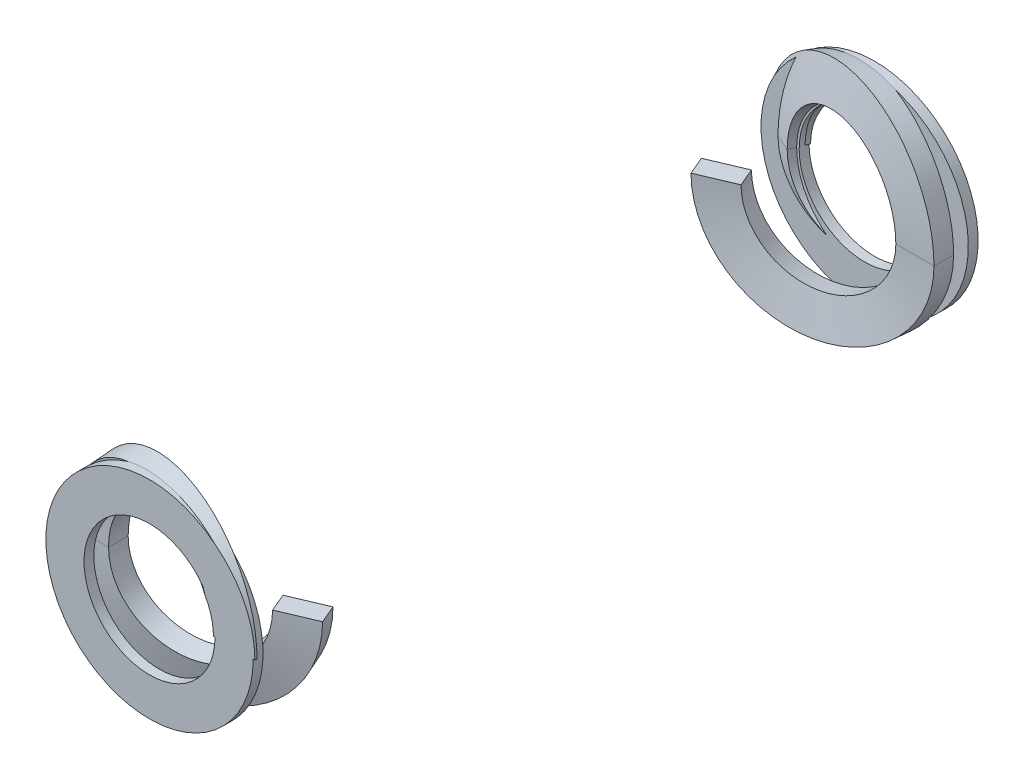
ISO-10303-21;
HEADER;
FILE_DESCRIPTION(('STEP AP214'),'2;1');
FILE_NAME('part.step','',(''),(''),'','','');
FILE_SCHEMA(('AUTOMOTIVE_DESIGN { 1 0 10303 214 1 1 1 1 }'));
ENDSEC;
DATA;
#1=APPLICATION_CONTEXT('core data for automotive mechanical design processes');
#2=APPLICATION_PROTOCOL_DEFINITION('international standard','automotive_design',2000,#1);
#3=PRODUCT_CONTEXT('',#1,'mechanical');
#4=PRODUCT('Part','Part','',(#3));
#5=PRODUCT_RELATED_PRODUCT_CATEGORY('part','',(#4));
#6=PRODUCT_DEFINITION_FORMATION('','',#4);
#7=PRODUCT_DEFINITION_CONTEXT('part definition',#1,'design');
#8=PRODUCT_DEFINITION('design','',#6,#7);
#9=PRODUCT_DEFINITION_SHAPE('','',#8);
#10=(LENGTH_UNIT() NAMED_UNIT(*) SI_UNIT(.MILLI.,.METRE.));
#11=(NAMED_UNIT(*) PLANE_ANGLE_UNIT() SI_UNIT($,.RADIAN.));
#12=(NAMED_UNIT(*) SI_UNIT($,.STERADIAN.) SOLID_ANGLE_UNIT());
#13=UNCERTAINTY_MEASURE_WITH_UNIT(LENGTH_MEASURE(1.E-05),#10,'distance_accuracy_value','');
#14=(GEOMETRIC_REPRESENTATION_CONTEXT(3) GLOBAL_UNCERTAINTY_ASSIGNED_CONTEXT((#13)) GLOBAL_UNIT_ASSIGNED_CONTEXT((#10,
#11,#12)) REPRESENTATION_CONTEXT('',''));
#15=CARTESIAN_POINT('',(0.,0.,0.));
#16=DIRECTION('',(0.,0.,1.));
#17=DIRECTION('',(1.,0.,0.));
#18=AXIS2_PLACEMENT_3D('',#15,#16,#17);
#19=CARTESIAN_POINT('',(-0.0669380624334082,-3.60822483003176E-13,-40.5876125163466));
#20=DIRECTION('',(-0.198946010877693,0.,0.980010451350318));
#21=DIRECTION('',(0.980010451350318,0.,0.198946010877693));
#22=AXIS2_PLACEMENT_3D('',#19,#20,#21);
#23=CONICAL_SURFACE('',#22,6.18328820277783,0.200282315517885);
#24=CARTESIAN_POINT('',(0.,-3.60822483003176E-13,-41.5256261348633));
#25=DIRECTION('',(-0.100983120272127,0.,0.994888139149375));
#26=DIRECTION('',(-0.994888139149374,0.,-0.100983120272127));
#27=AXIS2_PLACEMENT_3D('',#24,#25,#26);
#28=ELLIPSE('',#27,6.02354050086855,5.992749);
#29=CARTESIAN_POINT('',(-3.78686060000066,4.64464502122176,-41.9100000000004));
#30=VERTEX_POINT('',#29);
#31=CARTESIAN_POINT('',(1.80148774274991,5.71556493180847,-41.342771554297));
#32=VERTEX_POINT('',#31);
#33=EDGE_CURVE('E280',#30,#32,#28,.F.);
#34=ORIENTED_EDGE('',*,*,#33,.F.);
#35=CARTESIAN_POINT('',(-0.0474066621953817,-3.60822483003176E-13,-41.9100000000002));
#36=DIRECTION('',(0.,0.,1.));
#37=DIRECTION('',(-1.,0.,0.));
#38=AXIS2_PLACEMENT_3D('',#35,#36,#37);
#39=ELLIPSE('',#38,6.04015566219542,5.91438702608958);
#40=CARTESIAN_POINT('',(-6.08756232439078,-4.02455846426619E-13,-41.9100000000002));
#41=VERTEX_POINT('',#40);
#42=EDGE_CURVE('E70',#30,#41,#39,.T.);
#43=ORIENTED_EDGE('',*,*,#42,.T.);
#44=DIRECTION('',(0.389938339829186,0.,-0.920840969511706));
#45=VECTOR('',#44,1.);
#46=CARTESIAN_POINT('',(-5.68425688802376,-4.02455846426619E-13,-42.8624074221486));
#47=LINE('',#46,#45);
#48=CARTESIAN_POINT('',(-6.12662512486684,-4.02455846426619E-13,-41.8177530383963));
#49=VERTEX_POINT('',#48);
#50=EDGE_CURVE('E164',#49,#41,#47,.T.);
#51=ORIENTED_EDGE('',*,*,#50,.F.);
#52=CARTESIAN_POINT('',(-0.0669380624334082,-3.60822483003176E-13,-40.5876125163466));
#53=DIRECTION('',(0.198946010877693,0.,-0.980010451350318));
#54=DIRECTION('',(-0.980010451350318,0.,-0.198946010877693));
#55=AXIS2_PLACEMENT_3D('',#52,#53,#54);
#56=CIRCLE('',#55,6.18328820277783);
#57=CARTESIAN_POINT('',(5.99274900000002,-3.60822483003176E-13,-39.3574719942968));
#58=VERTEX_POINT('',#57);
#59=EDGE_CURVE('E189',#49,#58,#56,.T.);
#60=ORIENTED_EDGE('',*,*,#59,.T.);
#61=DIRECTION('',(0.,0.,-1.));
#62=VECTOR('',#61,1.);
#63=CARTESIAN_POINT('',(5.99274900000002,-3.60822483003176E-13,-40.4919288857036));
#64=LINE('',#63,#62);
#65=CARTESIAN_POINT('',(5.99274900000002,-3.60822483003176E-13,-40.4919288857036));
#66=VERTEX_POINT('',#65);
#67=EDGE_CURVE('E321',#58,#66,#64,.T.);
#68=ORIENTED_EDGE('',*,*,#67,.T.);
#69=CARTESIAN_POINT('',(0.154246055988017,-3.60822483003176E-13,-41.6771681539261));
#70=DIRECTION('',(0.198946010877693,0.,-0.980010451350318));
#71=DIRECTION('',(-0.980010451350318,0.,-0.198946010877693));
#72=AXIS2_PLACEMENT_3D('',#69,#70,#71);
#73=CIRCLE('',#72,5.95759252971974);
#74=EDGE_CURVE('E178',#32,#66,#73,.T.);
#75=ORIENTED_EDGE('',*,*,#74,.F.);
#76=EDGE_LOOP('',(#34,#43,#51,#60,#68,#75));
#77=FACE_BOUND('',#76,.T.);
#78=ADVANCED_FACE('F53',(#77),#23,.T.);
#79=CARTESIAN_POINT('',(-0.154246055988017,-3.60822483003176E-13,-40.1575322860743));
#80=DIRECTION('',(0.198946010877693,0.,-0.980010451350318));
#81=DIRECTION('',(-0.980010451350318,0.,-0.198946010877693));
#82=AXIS2_PLACEMENT_3D('',#79,#80,#81);
#83=CONICAL_SURFACE('',#82,4.0214945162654,1.37051401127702);
#84=CARTESIAN_POINT('',(-4.91312110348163,-1.34021941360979,-41.3427715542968));
#85=CARTESIAN_POINT('',(-4.93205843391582,-1.20205991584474,-41.3427715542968));
#86=CARTESIAN_POINT('',(-4.9481118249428,-1.06351964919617,-41.3427715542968));
#87=CARTESIAN_POINT('',(-4.97436271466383,-0.785883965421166,-41.3427715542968));
#88=CARTESIAN_POINT('',(-4.98456013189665,-0.646788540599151,-41.3427715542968));
#89=CARTESIAN_POINT('',(-5.00622681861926,-0.229156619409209,-41.3427715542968));
#90=CARTESIAN_POINT('',(-5.00879408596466,0.0498963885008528,-41.3427715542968));
#91=CARTESIAN_POINT('',(-4.99017708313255,0.604223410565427,-41.3427715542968));
#92=CARTESIAN_POINT('',(-4.9692425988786,0.879506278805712,-41.3427715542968));
#93=CARTESIAN_POINT('',(-4.90462499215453,1.42737942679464,-41.3427715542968));
#94=CARTESIAN_POINT('',(-4.86094169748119,1.69996968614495,-41.3427715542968));
#95=CARTESIAN_POINT('',(-4.75168949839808,2.24222304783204,-41.3427715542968));
#96=CARTESIAN_POINT('',(-4.6860049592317,2.51186274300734,-41.3427715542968));
#97=CARTESIAN_POINT('',(-4.53441485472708,3.04543681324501,-41.3427715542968));
#98=CARTESIAN_POINT('',(-4.44850120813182,3.3093688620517,-41.3427715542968));
#99=CARTESIAN_POINT('',(-4.1624246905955,4.09295742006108,-41.3427715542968));
#100=CARTESIAN_POINT('',(-3.93431197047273,4.60258947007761,-41.342771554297));
#101=CARTESIAN_POINT('',(-3.47190904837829,5.49007341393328,-41.342771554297));
#102=CARTESIAN_POINT('',(-3.24826988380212,5.87367775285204,-41.3427715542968));
#103=CARTESIAN_POINT('',(-2.77213777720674,6.61884306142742,-41.3427715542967));
#104=CARTESIAN_POINT('',(-2.51985856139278,6.98053995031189,-41.3427715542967));
#105=CARTESIAN_POINT('',(-2.2557431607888,7.33296841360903,-41.342771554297));
#106=B_SPLINE_CURVE_WITH_KNOTS('',3,(#84,#85,#86,#87,#88,#89,#90,#91,#92,#93,#94,#95,#96,#97,
#98,#99,#100,#101,#102,#103,#104,#105),.UNSPECIFIED.,.F.,.F.,(4,2,2,2,2,2,2,2,2,2,4),(0.,
0.418293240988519,0.836592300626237,1.67267466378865,2.49995424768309,3.32724009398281,
4.15894408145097,4.99098088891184,6.66057387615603,7.99129506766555,9.31266828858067),.UNSPECIFIED.);
#107=CARTESIAN_POINT('',(-5.00495442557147,-3.60822483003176E-13,-41.3427715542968));
#108=VERTEX_POINT('',#107);
#109=CARTESIAN_POINT('',(-3.97781644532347,4.48218885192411,-41.342771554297));
#110=VERTEX_POINT('',#109);
#111=EDGE_CURVE('E247',#108,#110,#106,.T.);
#112=ORIENTED_EDGE('',*,*,#111,.F.);
#113=DIRECTION('',(-0.920840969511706,0.,-0.389938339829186));
#114=VECTOR('',#113,1.);
#115=CARTESIAN_POINT('',(-6.12662512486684,-4.02455846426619E-13,-41.8177530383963));
#116=LINE('',#115,#114);
#117=CARTESIAN_POINT('',(-4.09535271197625,-3.60822483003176E-13,-40.9575925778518));
#118=VERTEX_POINT('',#117);
#119=EDGE_CURVE('E169',#118,#108,#116,.T.);
#120=ORIENTED_EDGE('',*,*,#119,.F.);
#121=CARTESIAN_POINT('',(-0.154246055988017,-3.60822483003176E-13,-40.1575322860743));
#122=DIRECTION('',(0.198946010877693,0.,-0.980010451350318));
#123=DIRECTION('',(-0.980010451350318,0.,-0.198946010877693));
#124=AXIS2_PLACEMENT_3D('',#121,#122,#123);
#125=CIRCLE('',#124,4.0214945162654);
#126=CARTESIAN_POINT('',(3.7868606,-3.60822483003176E-13,-39.3574719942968));
#127=VERTEX_POINT('',#126);
#128=EDGE_CURVE('E185',#118,#127,#125,.T.);
#129=ORIENTED_EDGE('',*,*,#128,.T.);
#130=DIRECTION('',(1.,0.,0.));
#131=VECTOR('',#130,1.);
#132=CARTESIAN_POINT('',(5.99274900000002,-3.60822483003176E-13,-39.3574719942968));
#133=LINE('',#132,#131);
#134=EDGE_CURVE('E172',#127,#58,#133,.T.);
#135=ORIENTED_EDGE('',*,*,#134,.T.);
#136=ORIENTED_EDGE('',*,*,#59,.F.);
#137=CARTESIAN_POINT('',(-5.99274900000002,-3.7470027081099E-13,-41.7610619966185));
#138=VERTEX_POINT('',#137);
#139=EDGE_CURVE('E163',#138,#49,#116,.T.);
#140=ORIENTED_EDGE('',*,*,#139,.F.);
#141=CARTESIAN_POINT('',(-0.475085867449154,5.97388767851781,-40.629980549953));
#142=CARTESIAN_POINT('',(-0.645786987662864,5.96032751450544,-40.6642874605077));
#143=CARTESIAN_POINT('',(-0.815909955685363,5.93942042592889,-40.6985405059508));
#144=CARTESIAN_POINT('',(-1.1538291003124,5.88311273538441,-40.7666982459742));
#145=CARTESIAN_POINT('',(-1.32162504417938,5.84771069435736,-40.800602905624));
#146=CARTESIAN_POINT('',(-1.65348235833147,5.7626682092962,-40.8677752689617));
#147=CARTESIAN_POINT('',(-1.81754804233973,5.71304522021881,-40.9010437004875));
#148=CARTESIAN_POINT('',(-2.14092804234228,5.59989557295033,-40.9667291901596));
#149=CARTESIAN_POINT('',(-2.3002429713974,5.53637071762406,-40.9991463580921));
#150=CARTESIAN_POINT('',(-2.73216086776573,5.34223284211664,-41.0871787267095));
#151=CARTESIAN_POINT('',(-2.99872875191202,5.19735079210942,-41.1416772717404));
#152=CARTESIAN_POINT('',(-3.50752209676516,4.86847566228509,-41.2459746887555));
#153=CARTESIAN_POINT('',(-3.74975149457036,4.68448892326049,-41.2957743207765));
#154=CARTESIAN_POINT('',(-4.10230009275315,4.37176870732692,-41.3684238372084));
#155=CARTESIAN_POINT('',(-4.22313537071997,4.25516134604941,-41.3933598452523));
#156=CARTESIAN_POINT('',(-4.45481075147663,4.01196714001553,-41.441227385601));
#157=CARTESIAN_POINT('',(-4.56565025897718,3.88537970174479,-41.4641587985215));
#158=CARTESIAN_POINT('',(-4.77652066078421,3.62301592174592,-41.5078334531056));
#159=CARTESIAN_POINT('',(-4.8765443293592,3.48723353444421,-41.5285752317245));
#160=CARTESIAN_POINT('',(-5.06493060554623,3.20748366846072,-41.5676786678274));
#161=CARTESIAN_POINT('',(-5.15329352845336,3.06351641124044,-41.5860403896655));
#162=CARTESIAN_POINT('',(-5.3175595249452,2.7685842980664,-41.6202032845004));
#163=CARTESIAN_POINT('',(-5.39347777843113,2.61762825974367,-41.6360075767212));
#164=CARTESIAN_POINT('',(-5.53235030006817,2.30968775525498,-41.6649374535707));
#165=CARTESIAN_POINT('',(-5.59530953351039,2.15270562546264,-41.6780640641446));
#166=CARTESIAN_POINT('',(-5.707722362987,1.83397623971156,-41.7015142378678));
#167=CARTESIAN_POINT('',(-5.7571913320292,1.67223464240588,-41.7118409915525));
#168=CARTESIAN_POINT('',(-5.84229489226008,1.3450624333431,-41.7296135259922));
#169=CARTESIAN_POINT('',(-5.87793467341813,1.17963323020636,-41.7370603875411));
#170=CARTESIAN_POINT('',(-5.93520045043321,0.845706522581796,-41.7490287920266));
#171=CARTESIAN_POINT('',(-5.95678090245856,0.677200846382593,-41.7535408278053));
#172=CARTESIAN_POINT('',(-5.98555334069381,0.3390742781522,-41.7595570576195));
#173=CARTESIAN_POINT('',(-5.99275748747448,0.169454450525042,-41.7610637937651));
#174=CARTESIAN_POINT('',(-5.99273873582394,-0.205221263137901,-41.7610598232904));
#175=CARTESIAN_POINT('',(-5.98219524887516,-0.410293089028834,-41.7588546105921));
#176=CARTESIAN_POINT('',(-5.95067555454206,-0.716283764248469,-41.7522644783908));
#177=CARTESIAN_POINT('',(-5.93753088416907,-0.818110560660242,-41.7495163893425));
#178=CARTESIAN_POINT('',(-5.90603895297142,-1.02091521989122,-41.7429339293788));
#179=CARTESIAN_POINT('',(-5.88769198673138,-1.12189313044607,-41.7390996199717));
#180=CARTESIAN_POINT('',(-5.86676611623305,-1.22233216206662,-41.7347273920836));
#181=B_SPLINE_CURVE_WITH_KNOTS('',3,(#141,#142,#143,#144,#145,#146,#147,#148,#149,#150,#151,
#152,#153,#154,#155,#156,#157,#158,#159,#160,#161,#162,#163,#164,#165,#166,#167,#168,#169,#170,
#171,#172,#173,#174,#175,#176,#177,#178,#179,#180),.UNSPECIFIED.,.F.,.F.,(4,2,2,2,2,2,2,2,2,2,2,
2,2,2,2,2,2,2,2,4),(0.,0.523761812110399,1.04757563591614,1.5707492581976,2.09385507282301,
3.01498228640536,3.93596025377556,4.44473782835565,4.95354568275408,5.46269138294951,
5.97182331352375,6.48032951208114,6.98864051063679,7.49636981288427,8.00390838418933,
8.51308300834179,9.02182675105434,9.63662515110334,9.94463120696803,10.2526198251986),.UNSPECIFIED.);
#182=EDGE_CURVE('E357',#110,#138,#181,.T.);
#183=ORIENTED_EDGE('',*,*,#182,.F.);
#184=EDGE_LOOP('',(#112,#120,#129,#135,#136,#140,#183));
#185=FACE_BOUND('',#184,.T.);
#186=ADVANCED_FACE('F55',(#185),#83,.T.);
#187=CARTESIAN_POINT('',(0.0669380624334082,-3.60822483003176E-13,-41.2470879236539));
#188=DIRECTION('',(-0.198946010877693,0.,0.980010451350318));
#189=DIRECTION('',(0.980010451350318,0.,0.198946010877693));
#190=AXIS2_PLACEMENT_3D('',#187,#188,#189);
#191=CONICAL_SURFACE('',#190,3.79579884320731,0.200282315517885);
#192=CARTESIAN_POINT('',(-0.0726923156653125,-3.60822483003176E-13,-41.3427715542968));
#193=DIRECTION('',(0.,0.,-1.));
#194=DIRECTION('',(-1.,0.,0.));
#195=AXIS2_PLACEMENT_3D('',#192,#193,#194);
#196=ELLIPSE('',#195,3.85955291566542,3.77918897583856);
#197=CARTESIAN_POINT('',(-0.404400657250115,3.76520561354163,-41.342771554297));
#198=VERTEX_POINT('',#197);
#199=CARTESIAN_POINT('',(-3.93224523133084,-3.60822483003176E-13,-41.3427715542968));
#200=VERTEX_POINT('',#199);
#201=EDGE_CURVE('E234',#198,#200,#196,.F.);
#202=ORIENTED_EDGE('',*,*,#201,.F.);
#203=CARTESIAN_POINT('',(0.0669380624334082,-3.60822483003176E-13,-41.2470879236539));
#204=DIRECTION('',(0.198946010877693,0.,-0.980010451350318));
#205=DIRECTION('',(-0.980010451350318,0.,-0.198946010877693));
#206=AXIS2_PLACEMENT_3D('',#203,#204,#205);
#207=CIRCLE('',#206,3.79579884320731);
#208=CARTESIAN_POINT('',(3.7868606,-3.60822483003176E-13,-40.4919288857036));
#209=VERTEX_POINT('',#208);
#210=EDGE_CURVE('E181',#198,#209,#207,.T.);
#211=ORIENTED_EDGE('',*,*,#210,.T.);
#212=DIRECTION('',(0.,0.,1.));
#213=VECTOR('',#212,1.);
#214=CARTESIAN_POINT('',(3.7868606,-3.60822483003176E-13,-40.4919288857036));
#215=LINE('',#214,#213);
#216=EDGE_CURVE('E329',#209,#127,#215,.T.);
#217=ORIENTED_EDGE('',*,*,#216,.T.);
#218=ORIENTED_EDGE('',*,*,#128,.F.);
#219=DIRECTION('',(0.389938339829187,0.,-0.920840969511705));
#220=VECTOR('',#219,1.);
#221=CARTESIAN_POINT('',(-3.93224523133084,-3.60822483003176E-13,-41.3427715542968));
#222=LINE('',#221,#220);
#223=EDGE_CURVE('E283',#118,#200,#222,.T.);
#224=ORIENTED_EDGE('',*,*,#223,.T.);
#225=EDGE_LOOP('',(#202,#211,#217,#218,#224));
#226=FACE_BOUND('',#225,.T.);
#227=ADVANCED_FACE('F375',(#226),#191,.F.);
#228=CARTESIAN_POINT('',(0.154246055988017,-3.60822483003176E-13,-41.6771681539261));
#229=DIRECTION('',(0.198946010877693,0.,-0.980010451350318));
#230=DIRECTION('',(-0.980010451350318,0.,-0.198946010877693));
#231=AXIS2_PLACEMENT_3D('',#228,#229,#230);
#232=CONICAL_SURFACE('',#231,5.95759252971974,1.37051401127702);
#233=CARTESIAN_POINT('',(4.20722903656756,7.2686906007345,-41.342771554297));
#234=CARTESIAN_POINT('',(3.87298283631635,7.07576627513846,-41.3427715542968));
#235=CARTESIAN_POINT('',(3.54176349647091,6.8772802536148,-41.3427715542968));
#236=CARTESIAN_POINT('',(2.88703289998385,6.46609822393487,-41.3427715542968));
#237=CARTESIAN_POINT('',(2.56354515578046,6.2533649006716,-41.3427715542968));
#238=CARTESIAN_POINT('',(1.92244868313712,5.80791949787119,-41.3427715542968));
#239=CARTESIAN_POINT('',(1.60502981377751,5.57493197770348,-41.3427715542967));
#240=CARTESIAN_POINT('',(0.986431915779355,5.08868166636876,-41.3427715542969));
#241=CARTESIAN_POINT('',(0.685234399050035,4.83544281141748,-41.342771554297));
#242=CARTESIAN_POINT('',(0.253577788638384,4.43949719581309,-41.3427715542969));
#243=CARTESIAN_POINT('',(0.11438861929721,4.30629195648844,-41.3427715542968));
#244=CARTESIAN_POINT('',(-0.157326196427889,4.03318244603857,-41.3427715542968));
#245=CARTESIAN_POINT('',(-0.289851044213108,3.89327737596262,-41.3427715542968));
#246=CARTESIAN_POINT('',(-0.546471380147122,3.60643600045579,-41.3427715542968));
#247=CARTESIAN_POINT('',(-0.670584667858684,3.45951573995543,-41.3427715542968));
#248=CARTESIAN_POINT('',(-0.908765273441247,3.15779571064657,-41.3427715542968));
#249=CARTESIAN_POINT('',(-1.0228347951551,3.00299768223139,-41.3427715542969));
#250=CARTESIAN_POINT('',(-1.30271502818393,2.59054173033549,-41.342771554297));
#251=CARTESIAN_POINT('',(-1.45912106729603,2.32629807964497,-41.3427715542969));
#252=CARTESIAN_POINT('',(-1.72806947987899,1.77654155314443,-41.3427715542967));
#253=CARTESIAN_POINT('',(-1.84072655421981,1.49108666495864,-41.3427715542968));
#254=CARTESIAN_POINT('',(-1.99130996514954,0.96373817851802,-41.3427715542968));
#255=CARTESIAN_POINT('',(-2.03983796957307,0.724952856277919,-41.3427715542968));
#256=CARTESIAN_POINT('',(-2.08163391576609,0.363301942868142,-41.3427715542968));
#257=CARTESIAN_POINT('',(-2.09039630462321,0.242107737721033,-41.3427715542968));
#258=CARTESIAN_POINT('',(-2.09738495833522,-0.000566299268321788,-41.3427715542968));
#259=CARTESIAN_POINT('',(-2.09561310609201,-0.122046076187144,-41.3427715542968));
#260=CARTESIAN_POINT('',(-2.078047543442,-0.424408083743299,-41.3427715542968));
#261=CARTESIAN_POINT('',(-2.05575328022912,-0.60495927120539,-41.3427715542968));
#262=CARTESIAN_POINT('',(-2.00576873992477,-0.872513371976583,-41.3427715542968));
#263=CARTESIAN_POINT('',(-1.98634460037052,-0.961169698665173,-41.3427715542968));
#264=CARTESIAN_POINT('',(-1.94228591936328,-1.13716681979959,-41.3427715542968));
#265=CARTESIAN_POINT('',(-1.9176521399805,-1.22450780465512,-41.3427715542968));
#266=CARTESIAN_POINT('',(-1.89056369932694,-1.31109807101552,-41.3427715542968));
#267=B_SPLINE_CURVE_WITH_KNOTS('',3,(#233,#234,#235,#236,#237,#238,#239,#240,#241,#242,#243,
#244,#245,#246,#247,#248,#249,#250,#251,#252,#253,#254,#255,#256,#257,#258,#259,#260,#261,#262,
#263,#264,#265,#266),.UNSPECIFIED.,.F.,.F.,(4,2,2,2,2,2,2,2,2,2,2,2,2,2,2,2,4),(0.,
1.15797376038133,2.31910888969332,3.49973655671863,4.67898883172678,5.25677885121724,
5.83463794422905,6.41123337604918,6.98770197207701,7.90584224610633,8.82155882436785,
9.54902999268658,9.91315129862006,10.2772075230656,10.8212900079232,11.0934380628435,
11.3655463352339),.UNSPECIFIED.);
#268=EDGE_CURVE('E237',#32,#198,#267,.T.);
#269=ORIENTED_EDGE('',*,*,#268,.F.);
#270=ORIENTED_EDGE('',*,*,#74,.T.);
#271=DIRECTION('',(-1.,0.,0.));
#272=VECTOR('',#271,1.);
#273=CARTESIAN_POINT('',(5.99274900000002,-3.60822483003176E-13,-40.4919288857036));
#274=LINE('',#273,#272);
#275=EDGE_CURVE('E325',#66,#209,#274,.T.);
#276=ORIENTED_EDGE('',*,*,#275,.T.);
#277=ORIENTED_EDGE('',*,*,#210,.F.);
#278=EDGE_LOOP('',(#269,#270,#276,#277));
#279=FACE_BOUND('',#278,.T.);
#280=ADVANCED_FACE('F371',(#279),#232,.F.);
#281=CARTESIAN_POINT('',(-6.12662512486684,-4.02455846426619E-13,-41.8177530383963));
#282=DIRECTION('',(0.,1.,0.));
#283=DIRECTION('',(0.389938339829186,0.,-0.920840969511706));
#284=AXIS2_PLACEMENT_3D('',#281,#282,#283);
#285=PLANE('',#284);
#286=ORIENTED_EDGE('',*,*,#50,.T.);
#287=DIRECTION('',(1.,0.,0.));
#288=VECTOR('',#287,1.);
#289=CARTESIAN_POINT('',(-6.12662512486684,-4.02455846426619E-13,-41.9100000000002));
#290=LINE('',#289,#288);
#291=CARTESIAN_POINT('',(-5.99274900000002,-3.7470027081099E-13,-41.9100000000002));
#292=VERTEX_POINT('',#291);
#293=EDGE_CURVE('E210',#41,#292,#290,.T.);
#294=ORIENTED_EDGE('',*,*,#293,.T.);
#295=DIRECTION('',(0.,0.,1.));
#296=VECTOR('',#295,1.);
#297=CARTESIAN_POINT('',(-5.99274900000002,0.,0.));
#298=LINE('',#297,#296);
#299=EDGE_CURVE('E193',#138,#292,#298,.F.);
#300=ORIENTED_EDGE('',*,*,#299,.F.);
#301=ORIENTED_EDGE('',*,*,#139,.T.);
#302=EDGE_LOOP('',(#286,#294,#300,#301));
#303=FACE_BOUND('',#302,.T.);
#304=ADVANCED_FACE('F354',(#303),#285,.F.);
#305=CARTESIAN_POINT('',(-0.0875016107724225,-3.60822483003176E-13,-42.3410339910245));
#306=DIRECTION('',(-0.198946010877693,0.,-0.980010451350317));
#307=DIRECTION('',(-0.980010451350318,0.,0.198946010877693));
#308=AXIS2_PLACEMENT_3D('',#305,#306,#307);
#309=CONICAL_SURFACE('',#308,5.01775548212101,0.969949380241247);
#310=ORIENTED_EDGE('',*,*,#119,.T.);
#311=CARTESIAN_POINT('',(-1.05484042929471,-3.60822483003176E-13,-41.3427715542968));
#312=DIRECTION('',(0.,0.,-1.));
#313=DIRECTION('',(-1.,0.,0.));
#314=AXIS2_PLACEMENT_3D('',#311,#312,#313);
#315=ELLIPSE('',#314,3.95011399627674,3.69744889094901);
#316=CARTESIAN_POINT('',(-2.19795642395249,-3.53924189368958,-41.3427715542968));
#317=VERTEX_POINT('',#316);
#318=EDGE_CURVE('E230',#108,#317,#315,.F.);
#319=ORIENTED_EDGE('',*,*,#318,.T.);
#320=CARTESIAN_POINT('',(0.023598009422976,-3.60822483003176E-13,-41.7937559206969));
#321=DIRECTION('',(-0.198946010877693,0.,-0.980010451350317));
#322=DIRECTION('',(-0.980010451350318,0.,0.198946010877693));
#323=AXIS2_PLACEMENT_3D('',#320,#321,#322);
#324=CIRCLE('',#323,4.20296611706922);
#325=EDGE_CURVE('E287',#317,#118,#324,.T.);
#326=ORIENTED_EDGE('',*,*,#325,.T.);
#327=EDGE_LOOP('',(#310,#319,#326));
#328=FACE_BOUND('',#327,.T.);
#329=ADVANCED_FACE('F270',(#328),#309,.T.);
#330=CARTESIAN_POINT('',(0.023598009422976,-3.60822483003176E-13,-41.7937559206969));
#331=DIRECTION('',(0.198946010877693,0.,0.980010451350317));
#332=DIRECTION('',(0.980010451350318,0.,-0.198946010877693));
#333=AXIS2_PLACEMENT_3D('',#330,#331,#332);
#334=CONICAL_SURFACE('',#333,4.20296611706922,0.600846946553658);
#335=ORIENTED_EDGE('',*,*,#325,.F.);
#336=CARTESIAN_POINT('',(0.769299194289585,-3.60822483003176E-13,-41.3427715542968));
#337=DIRECTION('',(0.,0.,-1.));
#338=DIRECTION('',(1.,0.,0.));
#339=AXIS2_PLACEMENT_3D('',#336,#337,#338);
#340=ELLIPSE('',#339,4.70154442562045,4.56274683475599);
#341=EDGE_CURVE('E226',#317,#200,#340,.T.);
#342=ORIENTED_EDGE('',*,*,#341,.T.);
#343=ORIENTED_EDGE('',*,*,#223,.F.);
#344=EDGE_LOOP('',(#335,#342,#343));
#345=FACE_BOUND('',#344,.T.);
#346=ADVANCED_FACE('F379',(#345),#334,.F.);
#347=CARTESIAN_POINT('',(-0.0669380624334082,-3.60822483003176E-13,-39.2617883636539));
#348=DIRECTION('',(0.198946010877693,0.,0.980010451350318));
#349=DIRECTION('',(0.980010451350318,0.,-0.198946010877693));
#350=AXIS2_PLACEMENT_3D('',#347,#348,#349);
#351=CONICAL_SURFACE('',#350,6.18328820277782,1.37051401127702);
#352=CARTESIAN_POINT('',(-0.154246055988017,-3.60822483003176E-13,-39.6918685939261));
#353=DIRECTION('',(0.198946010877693,0.,0.980010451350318));
#354=DIRECTION('',(0.980010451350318,0.,-0.198946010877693));
#355=AXIS2_PLACEMENT_3D('',#352,#353,#354);
#356=CIRCLE('',#355,4.0214945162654);
#357=CARTESIAN_POINT('',(-4.09535271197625,-1.45716771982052E-13,-38.8918083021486));
#358=VERTEX_POINT('',#357);
#359=EDGE_CURVE('E317',#358,#209,#356,.T.);
#360=ORIENTED_EDGE('',*,*,#359,.T.);
#361=ORIENTED_EDGE('',*,*,#275,.F.);
#362=CARTESIAN_POINT('',(-0.0669380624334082,-3.60822483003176E-13,-39.2617883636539));
#363=DIRECTION('',(0.198946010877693,0.,0.980010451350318));
#364=DIRECTION('',(0.980010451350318,0.,-0.198946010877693));
#365=AXIS2_PLACEMENT_3D('',#362,#363,#364);
#366=CIRCLE('',#365,6.18328820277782);
#367=CARTESIAN_POINT('',(-6.12662512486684,-1.31838984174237E-13,-38.0316478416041));
#368=VERTEX_POINT('',#367);
#369=EDGE_CURVE('E306',#368,#66,#366,.T.);
#370=ORIENTED_EDGE('',*,*,#369,.F.);
#371=DIRECTION('',(0.920840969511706,0.,-0.389938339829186));
#372=VECTOR('',#371,1.);
#373=CARTESIAN_POINT('',(-6.12662512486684,-1.31838984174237E-13,-38.0316478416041));
#374=LINE('',#373,#372);
#375=EDGE_CURVE('E290',#368,#358,#374,.T.);
#376=ORIENTED_EDGE('',*,*,#375,.T.);
#377=EDGE_LOOP('',(#360,#361,#370,#376));
#378=FACE_BOUND('',#377,.T.);
#379=ADVANCED_FACE('F386',(#378),#351,.T.);
#380=CARTESIAN_POINT('',(-0.154246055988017,-3.60822483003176E-13,-39.6918685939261));
#381=DIRECTION('',(-0.198946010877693,0.,-0.980010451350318));
#382=DIRECTION('',(-0.980010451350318,0.,0.198946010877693));
#383=AXIS2_PLACEMENT_3D('',#380,#381,#382);
#384=CONICAL_SURFACE('',#383,4.0214945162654,0.200282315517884);
#385=CARTESIAN_POINT('',(0.0669380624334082,-1.73472347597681E-13,-38.6023129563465));
#386=DIRECTION('',(0.198946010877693,0.,0.980010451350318));
#387=DIRECTION('',(0.980010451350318,0.,-0.198946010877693));
#388=AXIS2_PLACEMENT_3D('',#385,#386,#387);
#389=CIRCLE('',#388,3.7957988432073);
#390=CARTESIAN_POINT('',(-3.65298447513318,-1.45716771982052E-13,-37.8471539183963));
#391=VERTEX_POINT('',#390);
#392=EDGE_CURVE('E313',#391,#127,#389,.T.);
#393=ORIENTED_EDGE('',*,*,#392,.T.);
#394=ORIENTED_EDGE('',*,*,#216,.F.);
#395=ORIENTED_EDGE('',*,*,#359,.F.);
#396=DIRECTION('',(0.389938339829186,0.,0.920840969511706));
#397=VECTOR('',#396,1.);
#398=CARTESIAN_POINT('',(-4.09535271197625,-1.45716771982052E-13,-38.8918083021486));
#399=LINE('',#398,#397);
#400=EDGE_CURVE('E294',#358,#391,#399,.T.);
#401=ORIENTED_EDGE('',*,*,#400,.T.);
#402=EDGE_LOOP('',(#393,#394,#395,#401));
#403=FACE_BOUND('',#402,.T.);
#404=ADVANCED_FACE('F394',(#403),#384,.F.);
#405=CARTESIAN_POINT('',(0.0669380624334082,-1.73472347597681E-13,-38.6023129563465));
#406=DIRECTION('',(0.198946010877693,0.,0.980010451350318));
#407=DIRECTION('',(0.980010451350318,0.,-0.198946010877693));
#408=AXIS2_PLACEMENT_3D('',#405,#406,#407);
#409=CONICAL_SURFACE('',#408,3.7957988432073,1.37051401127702);
#410=CARTESIAN_POINT('',(0.154246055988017,-1.73472347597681E-13,-38.1722327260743));
#411=DIRECTION('',(0.198946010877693,0.,0.980010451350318));
#412=DIRECTION('',(0.980010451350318,0.,-0.198946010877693));
#413=AXIS2_PLACEMENT_3D('',#410,#411,#412);
#414=CIRCLE('',#413,5.95759252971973);
#415=CARTESIAN_POINT('',(-5.68425688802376,-1.31838984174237E-13,-36.9869934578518));
#416=VERTEX_POINT('',#415);
#417=EDGE_CURVE('E310',#416,#58,#414,.T.);
#418=ORIENTED_EDGE('',*,*,#417,.T.);
#419=ORIENTED_EDGE('',*,*,#134,.F.);
#420=ORIENTED_EDGE('',*,*,#392,.F.);
#421=DIRECTION('',(-0.920840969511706,0.,0.389938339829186));
#422=VECTOR('',#421,1.);
#423=CARTESIAN_POINT('',(-3.65298447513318,-1.45716771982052E-13,-37.8471539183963));
#424=LINE('',#423,#422);
#425=EDGE_CURVE('E298',#391,#416,#424,.T.);
#426=ORIENTED_EDGE('',*,*,#425,.T.);
#427=EDGE_LOOP('',(#418,#419,#420,#426));
#428=FACE_BOUND('',#427,.T.);
#429=ADVANCED_FACE('F343',(#428),#409,.F.);
#430=CARTESIAN_POINT('',(0.154246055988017,-1.73472347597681E-13,-38.1722327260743));
#431=DIRECTION('',(-0.198946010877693,0.,-0.980010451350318));
#432=DIRECTION('',(-0.980010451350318,0.,0.198946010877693));
#433=AXIS2_PLACEMENT_3D('',#430,#431,#432);
#434=CONICAL_SURFACE('',#433,5.95759252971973,0.200282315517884);
#435=DIRECTION('',(-0.389938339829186,0.,-0.920840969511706));
#436=VECTOR('',#435,1.);
#437=CARTESIAN_POINT('',(-5.68425688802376,-1.31838984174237E-13,-36.9869934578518));
#438=LINE('',#437,#436);
#439=EDGE_CURVE('E302',#416,#368,#438,.T.);
#440=ORIENTED_EDGE('',*,*,#439,.T.);
#441=ORIENTED_EDGE('',*,*,#369,.T.);
#442=ORIENTED_EDGE('',*,*,#67,.F.);
#443=ORIENTED_EDGE('',*,*,#417,.F.);
#444=EDGE_LOOP('',(#440,#441,#442,#443));
#445=FACE_BOUND('',#444,.T.);
#446=ADVANCED_FACE('F348',(#445),#434,.T.);
#447=CARTESIAN_POINT('',(-4.09535271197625,-1.45716771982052E-13,-38.8918083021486));
#448=DIRECTION('',(0.,-1.,0.));
#449=DIRECTION('',(0.389938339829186,0.,0.920840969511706));
#450=AXIS2_PLACEMENT_3D('',#447,#448,#449);
#451=PLANE('',#450);
#452=ORIENTED_EDGE('',*,*,#375,.F.);
#453=ORIENTED_EDGE('',*,*,#439,.F.);
#454=ORIENTED_EDGE('',*,*,#425,.F.);
#455=ORIENTED_EDGE('',*,*,#400,.F.);
#456=EDGE_LOOP('',(#452,#453,#454,#455));
#457=FACE_BOUND('',#456,.T.);
#458=ADVANCED_FACE('F269',(#457),#451,.F.);
#459=CARTESIAN_POINT('',(0.,0.,0.));
#460=DIRECTION('',(0.,0.,1.));
#461=DIRECTION('',(1.,0.,0.));
#462=AXIS2_PLACEMENT_3D('',#459,#460,#461);
#463=CYLINDRICAL_SURFACE('',#462,3.7868606);
#464=CARTESIAN_POINT('',(-0.403437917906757,3.76530889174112,-41.342571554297));
#465=CARTESIAN_POINT('',(-0.511276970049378,3.75376481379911,-41.3649735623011));
#466=CARTESIAN_POINT('',(-0.618629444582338,3.73756650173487,-41.3873160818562));
#467=CARTESIAN_POINT('',(-0.831606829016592,3.69601053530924,-41.4317206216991));
#468=CARTESIAN_POINT('',(-0.93723172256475,3.67065279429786,-41.4537826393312));
#469=CARTESIAN_POINT('',(-1.14600020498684,3.61092653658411,-41.4974647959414));
#470=CARTESIAN_POINT('',(-1.24914372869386,3.57655778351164,-41.5190849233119));
#471=CARTESIAN_POINT('',(-1.45220080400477,3.49903339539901,-41.5617201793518));
#472=CARTESIAN_POINT('',(-1.55211443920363,3.45587798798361,-41.5827353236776));
#473=CARTESIAN_POINT('',(-1.74789927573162,3.36109805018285,-41.6239822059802));
#474=CARTESIAN_POINT('',(-1.84377391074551,3.30948090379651,-41.6442146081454));
#475=CARTESIAN_POINT('',(-2.03089479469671,3.19806819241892,-41.6837634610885));
#476=CARTESIAN_POINT('',(-2.12213940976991,3.13826976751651,-41.7030795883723));
#477=CARTESIAN_POINT('',(-2.29921732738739,3.01094623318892,-41.7406204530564));
#478=CARTESIAN_POINT('',(-2.3850540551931,2.94342609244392,-41.7588458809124));
#479=CARTESIAN_POINT('',(-2.55071630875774,2.80108639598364,-41.7940674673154));
#480=CARTESIAN_POINT('',(-2.63054197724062,2.72626701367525,-41.8110636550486));
#481=CARTESIAN_POINT('',(-2.78239918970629,2.57102696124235,-41.8434360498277));
#482=CARTESIAN_POINT('',(-2.85453015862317,2.49070783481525,-41.8588328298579));
#483=CARTESIAN_POINT('',(-2.9917622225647,2.32407338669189,-41.8881575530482));
#484=CARTESIAN_POINT('',(-3.05686598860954,2.23776036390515,-41.9020860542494));
#485=CARTESIAN_POINT('',(-3.17960481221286,2.05964405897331,-41.9283702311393));
#486=CARTESIAN_POINT('',(-3.23723366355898,1.96783630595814,-41.9407245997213));
#487=CARTESIAN_POINT('',(-3.34446632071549,1.77949316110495,-41.9637317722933));
#488=CARTESIAN_POINT('',(-3.39407340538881,1.68295972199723,-41.9743852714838));
#489=CARTESIAN_POINT('',(-3.48393284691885,1.48788998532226,-41.9936963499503));
#490=CARTESIAN_POINT('',(-3.52435815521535,1.38943697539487,-42.0023908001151));
#491=CARTESIAN_POINT('',(-3.59680081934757,1.18938982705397,-42.0179795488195));
#492=CARTESIAN_POINT('',(-3.62882161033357,1.08779699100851,-42.0248745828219));
#493=CARTESIAN_POINT('',(-3.68417409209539,0.882316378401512,-42.0367981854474));
#494=CARTESIAN_POINT('',(-3.70751759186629,0.778431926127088,-42.0418292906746));
#495=CARTESIAN_POINT('',(-3.74537315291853,0.569036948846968,-42.0499900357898));
#496=CARTESIAN_POINT('',(-3.7598899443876,0.463527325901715,-42.053120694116));
#497=CARTESIAN_POINT('',(-3.77558258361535,0.29810076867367,-42.0565052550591));
#498=CARTESIAN_POINT('',(-3.77981701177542,0.238471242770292,-42.057418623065));
#499=CARTESIAN_POINT('',(-3.78545563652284,0.119163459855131,-42.0586349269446));
#500=CARTESIAN_POINT('',(-3.78686413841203,0.0594854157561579,-42.0589387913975));
#501=CARTESIAN_POINT('',(-3.78686059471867,-0.000200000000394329,-42.0589380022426));
#502=B_SPLINE_CURVE_WITH_KNOTS('',3,(#464,#465,#466,#467,#468,#469,#470,#471,#472,#473,#474,
#475,#476,#477,#478,#479,#480,#481,#482,#483,#484,#485,#486,#487,#488,#489,#490,#491,#492,#493,
#494,#495,#496,#497,#498,#499,#500,#501),.UNSPECIFIED.,.F.,.F.,(4,2,2,2,2,2,2,2,2,2,2,2,2,2,2,2,
2,2,4),(0.,0.332135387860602,0.664273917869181,0.996421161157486,1.32855980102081,
1.6604101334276,1.99237676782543,2.32413098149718,2.65587731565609,2.98261830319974,
3.30923465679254,3.6361204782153,3.96287234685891,4.28283516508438,4.60266700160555,
4.92206196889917,5.24128562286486,5.42058294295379,5.5996068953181),.UNSPECIFIED.);
#503=CARTESIAN_POINT('',(-3.09381835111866,2.18371271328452,-41.9100000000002));
#504=VERTEX_POINT('',#503);
#505=EDGE_CURVE('E204',#198,#504,#502,.T.);
#506=ORIENTED_EDGE('',*,*,#505,.T.);
#507=CARTESIAN_POINT('',(0.,-3.60822483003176E-13,-41.9100000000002));
#508=DIRECTION('',(0.,0.,1.));
#509=DIRECTION('',(1.,0.,0.));
#510=AXIS2_PLACEMENT_3D('',#507,#508,#509);
#511=CIRCLE('',#510,3.7868606);
#512=CARTESIAN_POINT('',(-3.7868606,-3.88578058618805E-13,-41.9100000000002));
#513=VERTEX_POINT('',#512);
#514=EDGE_CURVE('E157',#504,#513,#511,.F.);
#515=ORIENTED_EDGE('',*,*,#514,.T.);
#516=DIRECTION('',(0.,0.,1.));
#517=VECTOR('',#516,1.);
#518=CARTESIAN_POINT('',(-3.7868606,0.,0.));
#519=LINE('',#518,#517);
#520=CARTESIAN_POINT('',(-3.7868606,-3.46944695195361E-13,-41.6860979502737));
#521=VERTEX_POINT('',#520);
#522=EDGE_CURVE('E63',#513,#521,#519,.T.);
#523=ORIENTED_EDGE('',*,*,#522,.T.);
#524=CARTESIAN_POINT('',(0.,-3.60822483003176E-13,-41.3017240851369));
#525=DIRECTION('',(-0.100983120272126,0.,0.994888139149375));
#526=DIRECTION('',(-0.994888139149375,0.,-0.100983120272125));
#527=AXIS2_PLACEMENT_3D('',#524,#525,#526);
#528=ELLIPSE('',#527,3.80631796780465,3.7868606);
#529=EDGE_CURVE('E161',#521,#198,#528,.F.);
#530=ORIENTED_EDGE('',*,*,#529,.T.);
#531=CARTESIAN_POINT('',(0.,-3.60822483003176E-13,-41.3427715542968));
#532=DIRECTION('',(0.,0.,1.));
#533=DIRECTION('',(1.,0.,0.));
#534=AXIS2_PLACEMENT_3D('',#531,#532,#533);
#535=CIRCLE('',#534,3.7868606);
#536=EDGE_CURVE('E223',#198,#198,#535,.T.);
#537=ORIENTED_EDGE('',*,*,#536,.T.);
#538=EDGE_LOOP('',(#506,#515,#523,#530,#537));
#539=FACE_BOUND('',#538,.T.);
#540=ADVANCED_FACE('F200',(#539),#463,.F.);
#541=CARTESIAN_POINT('',(0.,0.,0.));
#542=DIRECTION('',(0.,0.,1.));
#543=DIRECTION('',(1.,0.,0.));
#544=AXIS2_PLACEMENT_3D('',#541,#542,#543);
#545=CYLINDRICAL_SURFACE('',#544,5.992749);
#546=ORIENTED_EDGE('',*,*,#299,.T.);
#547=CARTESIAN_POINT('',(0.,-3.60822483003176E-13,-41.9100000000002));
#548=DIRECTION('',(0.,0.,1.));
#549=DIRECTION('',(1.,0.,0.));
#550=AXIS2_PLACEMENT_3D('',#547,#548,#549);
#551=CIRCLE('',#550,5.992749);
#552=EDGE_CURVE('E206',#292,#30,#551,.T.);
#553=ORIENTED_EDGE('',*,*,#552,.T.);
#554=ORIENTED_EDGE('',*,*,#33,.T.);
#555=CARTESIAN_POINT('',(0.,-3.60822483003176E-13,-41.3427715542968));
#556=DIRECTION('',(0.,0.,1.));
#557=DIRECTION('',(1.,0.,0.));
#558=AXIS2_PLACEMENT_3D('',#555,#556,#557);
#559=CIRCLE('',#558,5.992749);
#560=EDGE_CURVE('E219',#110,#32,#559,.T.);
#561=ORIENTED_EDGE('',*,*,#560,.F.);
#562=ORIENTED_EDGE('',*,*,#182,.T.);
#563=EDGE_LOOP('',(#546,#553,#554,#561,#562));
#564=FACE_BOUND('',#563,.T.);
#565=ADVANCED_FACE('F261',(#564),#545,.T.);
#566=CARTESIAN_POINT('',(-5.99274900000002,-3.60822483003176E-13,-41.3427715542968));
#567=DIRECTION('',(0.,0.,-1.));
#568=DIRECTION('',(-1.,0.,0.));
#569=AXIS2_PLACEMENT_3D('',#566,#567,#568);
#570=PLANE('',#569);
#571=ORIENTED_EDGE('',*,*,#318,.F.);
#572=ORIENTED_EDGE('',*,*,#111,.T.);
#573=ORIENTED_EDGE('',*,*,#560,.T.);
#574=ORIENTED_EDGE('',*,*,#268,.T.);
#575=ORIENTED_EDGE('',*,*,#536,.F.);
#576=ORIENTED_EDGE('',*,*,#201,.T.);
#577=ORIENTED_EDGE('',*,*,#341,.F.);
#578=EDGE_LOOP('',(#571,#572,#573,#574,#575,#576,#577));
#579=FACE_BOUND('',#578,.T.);
#580=ADVANCED_FACE('F256',(#579),#570,.F.);
#581=ORIENTED_EDGE('',*,*,#522,.F.);
#582=DIRECTION('',(1.,0.,0.));
#583=VECTOR('',#582,1.);
#584=CARTESIAN_POINT('',(-6.12662512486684,-4.02455846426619E-13,-41.9100000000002));
#585=LINE('',#584,#583);
#586=CARTESIAN_POINT('',(-3.69204727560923,-3.88578058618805E-13,-41.9100000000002));
#587=VERTEX_POINT('',#586);
#588=EDGE_CURVE('E145',#513,#587,#585,.T.);
#589=ORIENTED_EDGE('',*,*,#588,.T.);
#590=DIRECTION('',(-0.389938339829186,0.,0.920840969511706));
#591=VECTOR('',#590,1.);
#592=CARTESIAN_POINT('',(-3.65298447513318,-3.88578058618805E-13,-42.0022469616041));
#593=LINE('',#592,#591);
#594=EDGE_CURVE('E154',#587,#521,#593,.T.);
#595=ORIENTED_EDGE('',*,*,#594,.T.);
#596=EDGE_LOOP('',(#581,#589,#595));
#597=FACE_BOUND('',#596,.T.);
#598=ADVANCED_FACE('F153',(#597),#285,.F.);
#599=CARTESIAN_POINT('',(-3.19857482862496,1.81798294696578,-41.9100000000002));
#600=VERTEX_POINT('',#599);
#601=EDGE_CURVE('E182',#600,#198,#207,.T.);
#602=ORIENTED_EDGE('',*,*,#601,.F.);
#603=CARTESIAN_POINT('',(-3.415542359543,-0.523294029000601,-41.9100000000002));
#604=CARTESIAN_POINT('',(-3.43067780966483,-0.322494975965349,-41.9100000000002));
#605=CARTESIAN_POINT('',(-3.43702094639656,-0.121049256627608,-41.9100000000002));
#606=CARTESIAN_POINT('',(-3.43234331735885,0.281516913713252,-41.9100000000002));
#607=CARTESIAN_POINT('',(-3.42133344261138,0.482637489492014,-41.9100000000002));
#608=CARTESIAN_POINT('',(-3.38264550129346,0.878518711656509,-41.9100000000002));
#609=CARTESIAN_POINT('',(-3.35536223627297,1.07331827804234,-41.9100000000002));
#610=CARTESIAN_POINT('',(-3.28522845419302,1.46007500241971,-41.9100000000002));
#611=CARTESIAN_POINT('',(-3.24237764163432,1.65203210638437,-41.9100000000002));
#612=CARTESIAN_POINT('',(-3.13552816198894,2.05722474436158,-41.9100000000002));
#613=CARTESIAN_POINT('',(-3.06948308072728,2.26991978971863,-41.9100000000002));
#614=CARTESIAN_POINT('',(-2.92059521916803,2.68936753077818,-41.9100000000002));
#615=CARTESIAN_POINT('',(-2.8377475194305,2.8961184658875,-41.9100000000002));
#616=CARTESIAN_POINT('',(-2.65470704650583,3.30864079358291,-41.9100000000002));
#617=CARTESIAN_POINT('',(-2.55409610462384,3.51422516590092,-41.9100000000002));
#618=CARTESIAN_POINT('',(-2.33938389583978,3.91782685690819,-41.9100000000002));
#619=CARTESIAN_POINT('',(-2.22530429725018,4.11585566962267,-41.9100000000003));
#620=CARTESIAN_POINT('',(-2.10541670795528,4.31015462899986,-41.9100000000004));
#621=B_SPLINE_CURVE_WITH_KNOTS('',3,(#603,#604,#605,#606,#607,#608,#609,#610,#611,#612,#613,
#614,#615,#616,#617,#618,#619,#620),.UNSPECIFIED.,.F.,.F.,(4,2,2,2,2,2,2,2,4),(0.,
0.603894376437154,1.20740989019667,1.7968474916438,2.38629628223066,3.0536440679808,
3.72118752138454,4.40728887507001,5.09230109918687),.UNSPECIFIED.);
#622=EDGE_CURVE('E78',#600,#504,#621,.T.);
#623=ORIENTED_EDGE('',*,*,#622,.T.);
#624=ORIENTED_EDGE('',*,*,#505,.F.);
#625=EDGE_LOOP('',(#602,#623,#624));
#626=FACE_BOUND('',#625,.T.);
#627=ADVANCED_FACE('F253',(#626),#232,.F.);
#628=ORIENTED_EDGE('',*,*,#594,.F.);
#629=CARTESIAN_POINT('',(0.0474066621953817,-3.60822483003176E-13,-41.9100000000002));
#630=DIRECTION('',(0.,0.,1.));
#631=DIRECTION('',(-1.,0.,0.));
#632=AXIS2_PLACEMENT_3D('',#629,#630,#631);
#633=ELLIPSE('',#632,3.73945393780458,3.66159070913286);
#634=EDGE_CURVE('E12',#587,#600,#633,.F.);
#635=ORIENTED_EDGE('',*,*,#634,.T.);
#636=ORIENTED_EDGE('',*,*,#601,.T.);
#637=ORIENTED_EDGE('',*,*,#529,.F.);
#638=EDGE_LOOP('',(#628,#635,#636,#637));
#639=FACE_BOUND('',#638,.T.);
#640=ADVANCED_FACE('F159',(#639),#191,.F.);
#641=CARTESIAN_POINT('',(6.35000000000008,-6.18328820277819,-41.9100000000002));
#642=DIRECTION('',(0.,0.,1.));
#643=DIRECTION('',(1.,0.,0.));
#644=AXIS2_PLACEMENT_3D('',#641,#642,#643);
#645=PLANE('',#644);
#646=ORIENTED_EDGE('',*,*,#622,.F.);
#647=ORIENTED_EDGE('',*,*,#634,.F.);
#648=ORIENTED_EDGE('',*,*,#588,.F.);
#649=ORIENTED_EDGE('',*,*,#514,.F.);
#650=EDGE_LOOP('',(#646,#647,#648,#649));
#651=FACE_BOUND('',#650,.T.);
#652=ORIENTED_EDGE('',*,*,#552,.F.);
#653=ORIENTED_EDGE('',*,*,#293,.F.);
#654=ORIENTED_EDGE('',*,*,#42,.F.);
#655=EDGE_LOOP('',(#652,#653,#654));
#656=FACE_BOUND('',#655,.T.);
#657=ADVANCED_FACE('F144',(#651,#656),#645,.F.);
#658=CLOSED_SHELL('',(#78,#186,#227,#280,#304,#329,#346,#379,#404,#429,#446,#458,#540,#565,#580,
#598,#627,#640,#657));
#659=MANIFOLD_SOLID_BREP('B2',#658);
#660=CARTESIAN_POINT('',(0.154246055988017,0.,-1.75246771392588));
#661=DIRECTION('',(0.198946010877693,0.,-0.980010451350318));
#662=DIRECTION('',(-0.980010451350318,0.,-0.198946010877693));
#663=AXIS2_PLACEMENT_3D('',#660,#661,#662);
#664=CONICAL_SURFACE('',#663,4.0214945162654,0.200282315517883);
#665=CARTESIAN_POINT('',(0.0726923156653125,0.,-0.567228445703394));
#666=DIRECTION('',(0.,0.,-1.));
#667=DIRECTION('',(1.,0.,0.));
#668=AXIS2_PLACEMENT_3D('',#665,#666,#667);
#669=ELLIPSE('',#668,3.85955291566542,3.77918897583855);
#670=CARTESIAN_POINT('',(0.404400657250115,3.76520561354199,-0.567228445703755));
#671=VERTEX_POINT('',#670);
#672=CARTESIAN_POINT('',(3.93224523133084,0.,-0.567228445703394));
#673=VERTEX_POINT('',#672);
#674=EDGE_CURVE('E883',#671,#673,#669,.T.);
#675=ORIENTED_EDGE('',*,*,#674,.F.);
#676=CARTESIAN_POINT('',(-0.0669380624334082,0.,-0.662912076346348));
#677=DIRECTION('',(-0.198946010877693,0.,0.980010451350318));
#678=DIRECTION('',(0.980010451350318,0.,0.198946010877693));
#679=AXIS2_PLACEMENT_3D('',#676,#677,#678);
#680=CIRCLE('',#679,3.79579884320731);
#681=CARTESIAN_POINT('',(-3.7868606,0.,-1.41807111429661));
#682=VERTEX_POINT('',#681);
#683=EDGE_CURVE('E700',#671,#682,#680,.T.);
#684=ORIENTED_EDGE('',*,*,#683,.T.);
#685=DIRECTION('',(0.,0.,1.));
#686=VECTOR('',#685,1.);
#687=CARTESIAN_POINT('',(-3.7868606,0.,-1.41807111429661));
#688=LINE('',#687,#686);
#689=CARTESIAN_POINT('',(-3.7868606,0.,-2.55252800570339));
#690=VERTEX_POINT('',#689);
#691=EDGE_CURVE('E758',#690,#682,#688,.T.);
#692=ORIENTED_EDGE('',*,*,#691,.F.);
#693=CARTESIAN_POINT('',(0.154246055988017,0.,-1.75246771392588));
#694=DIRECTION('',(-0.198946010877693,0.,0.980010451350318));
#695=DIRECTION('',(0.980010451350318,0.,0.198946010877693));
#696=AXIS2_PLACEMENT_3D('',#693,#694,#695);
#697=CIRCLE('',#696,4.0214945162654);
#698=CARTESIAN_POINT('',(4.09535271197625,0.,-0.95240742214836));
#699=VERTEX_POINT('',#698);
#700=EDGE_CURVE('E704',#699,#690,#697,.T.);
#701=ORIENTED_EDGE('',*,*,#700,.F.);
#702=DIRECTION('',(-0.389938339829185,0.,0.920840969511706));
#703=VECTOR('',#702,1.);
#704=CARTESIAN_POINT('',(3.65298447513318,0.,0.0922469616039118));
#705=LINE('',#704,#703);
#706=EDGE_CURVE('E685',#699,#673,#705,.T.);
#707=ORIENTED_EDGE('',*,*,#706,.T.);
#708=EDGE_LOOP('',(#675,#684,#692,#701,#707));
#709=FACE_BOUND('',#708,.T.);
#710=ADVANCED_FACE('F577',(#709),#664,.F.);
#711=CARTESIAN_POINT('',(-0.0669380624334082,0.,-0.662912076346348));
#712=DIRECTION('',(-0.198946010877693,0.,0.980010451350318));
#713=DIRECTION('',(0.980010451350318,0.,0.198946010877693));
#714=AXIS2_PLACEMENT_3D('',#711,#712,#713);
#715=CONICAL_SURFACE('',#714,3.79579884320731,1.37051401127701);
#716=CARTESIAN_POINT('',(-4.20722903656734,7.26869060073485,-0.567228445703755));
#717=CARTESIAN_POINT('',(-3.87298283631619,7.07576627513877,-0.567228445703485));
#718=CARTESIAN_POINT('',(-3.54176349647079,6.87728025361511,-0.567228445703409));
#719=CARTESIAN_POINT('',(-2.8870328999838,6.46609822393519,-0.567228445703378));
#720=CARTESIAN_POINT('',(-2.56354515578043,6.25336490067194,-0.567228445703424));
#721=CARTESIAN_POINT('',(-1.9224486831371,5.80791949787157,-0.567228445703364));
#722=CARTESIAN_POINT('',(-1.60502981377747,5.57493197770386,-0.567228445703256));
#723=CARTESIAN_POINT('',(-0.986431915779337,5.08868166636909,-0.567228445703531));
#724=CARTESIAN_POINT('',(-0.685234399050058,4.83544281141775,-0.567228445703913));
#725=CARTESIAN_POINT('',(-0.253577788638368,4.43949719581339,-0.567228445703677));
#726=CARTESIAN_POINT('',(-0.114388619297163,4.30629195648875,-0.56722844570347));
#727=CARTESIAN_POINT('',(0.157326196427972,4.03318244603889,-0.567228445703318));
#728=CARTESIAN_POINT('',(0.289851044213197,3.89327737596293,-0.567228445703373));
#729=CARTESIAN_POINT('',(0.546471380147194,3.60643600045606,-0.567228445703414));
#730=CARTESIAN_POINT('',(0.670584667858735,3.45951573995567,-0.567228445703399));
#731=CARTESIAN_POINT('',(0.908765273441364,3.15779571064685,-0.567228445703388));
#732=CARTESIAN_POINT('',(1.0228347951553,3.00299768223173,-0.567228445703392));
#733=CARTESIAN_POINT('',(1.30271502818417,2.59054173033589,-0.567228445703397));
#734=CARTESIAN_POINT('',(1.45912106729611,2.3262980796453,-0.567228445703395));
#735=CARTESIAN_POINT('',(1.72806947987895,1.77654155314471,-0.567228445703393));
#736=CARTESIAN_POINT('',(1.8407265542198,1.49108666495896,-0.567228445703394));
#737=CARTESIAN_POINT('',(1.99130996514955,0.963738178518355,-0.567228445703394));
#738=CARTESIAN_POINT('',(2.03983796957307,0.724952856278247,-0.567228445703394));
#739=CARTESIAN_POINT('',(2.08163391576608,0.363301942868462,-0.567228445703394));
#740=CARTESIAN_POINT('',(2.0903963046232,0.242107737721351,-0.567228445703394));
#741=CARTESIAN_POINT('',(2.09738495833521,-0.000566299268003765,-0.567228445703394));
#742=CARTESIAN_POINT('',(2.09561310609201,-0.122046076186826,-0.567228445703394));
#743=CARTESIAN_POINT('',(2.078047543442,-0.424408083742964,-0.567228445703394));
#744=CARTESIAN_POINT('',(2.05575328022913,-0.60495927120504,-0.567228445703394));
#745=CARTESIAN_POINT('',(2.00576873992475,-0.872513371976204,-0.567228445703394));
#746=CARTESIAN_POINT('',(1.9863446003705,-0.961169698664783,-0.567228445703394));
#747=CARTESIAN_POINT('',(1.9422859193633,-1.1371668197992,-0.567228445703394));
#748=CARTESIAN_POINT('',(1.91765213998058,-1.22450780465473,-0.567228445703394));
#749=CARTESIAN_POINT('',(1.89056369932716,-1.31109807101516,-0.567228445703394));
#750=B_SPLINE_CURVE_WITH_KNOTS('',3,(#716,#717,#718,#719,#720,#721,#722,#723,#724,#725,#726,
#727,#728,#729,#730,#731,#732,#733,#734,#735,#736,#737,#738,#739,#740,#741,#742,#743,#744,#745,
#746,#747,#748,#749),.UNSPECIFIED.,.F.,.F.,(4,2,2,2,2,2,2,2,2,2,2,2,2,2,2,2,4),(0.,
1.15797376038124,2.31910888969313,3.49973655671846,4.67898883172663,5.25677885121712,
5.83463794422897,6.41123337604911,6.98770197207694,7.90584224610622,8.82155882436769,
9.54902999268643,9.91315129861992,10.2772075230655,10.821290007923,11.0934380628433,
11.3655463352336),.UNSPECIFIED.);
#751=CARTESIAN_POINT('',(-1.80148774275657,5.71556493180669,-0.567228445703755));
#752=VERTEX_POINT('',#751);
#753=EDGE_CURVE('E737',#752,#671,#750,.T.);
#754=ORIENTED_EDGE('',*,*,#753,.F.);
#755=CARTESIAN_POINT('',(-0.154246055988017,0.,-0.232831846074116));
#756=DIRECTION('',(-0.198946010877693,0.,0.980010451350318));
#757=DIRECTION('',(0.980010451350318,0.,0.198946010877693));
#758=AXIS2_PLACEMENT_3D('',#755,#756,#757);
#759=CIRCLE('',#758,5.95759252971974);
#760=CARTESIAN_POINT('',(-5.99274900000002,0.,-1.41807111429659));
#761=VERTEX_POINT('',#760);
#762=EDGE_CURVE('E692',#752,#761,#759,.T.);
#763=ORIENTED_EDGE('',*,*,#762,.T.);
#764=DIRECTION('',(-1.,0.,0.));
#765=VECTOR('',#764,1.);
#766=CARTESIAN_POINT('',(-5.99274900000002,0.,-1.41807111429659));
#767=LINE('',#766,#765);
#768=EDGE_CURVE('E753',#682,#761,#767,.T.);
#769=ORIENTED_EDGE('',*,*,#768,.F.);
#770=ORIENTED_EDGE('',*,*,#683,.F.);
#771=EDGE_LOOP('',(#754,#763,#769,#770));
#772=FACE_BOUND('',#771,.T.);
#773=ADVANCED_FACE('F847',(#772),#715,.F.);
#774=CARTESIAN_POINT('',(5.68425688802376,0.,0.95240742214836));
#775=DIRECTION('',(0.,1.,0.));
#776=DIRECTION('',(0.389938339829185,0.,-0.920840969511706));
#777=AXIS2_PLACEMENT_3D('',#774,#775,#776);
#778=PLANE('',#777);
#779=DIRECTION('',(0.389938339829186,0.,-0.920840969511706));
#780=VECTOR('',#779,1.);
#781=CARTESIAN_POINT('',(5.68425688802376,0.,0.95240742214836));
#782=LINE('',#781,#780);
#783=CARTESIAN_POINT('',(6.08756232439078,0.,0.));
#784=VERTEX_POINT('',#783);
#785=CARTESIAN_POINT('',(6.12662512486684,0.,-0.0922469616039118));
#786=VERTEX_POINT('',#785);
#787=EDGE_CURVE('E750',#784,#786,#782,.T.);
#788=ORIENTED_EDGE('',*,*,#787,.F.);
#789=DIRECTION('',(-1.,0.,0.));
#790=VECTOR('',#789,1.);
#791=CARTESIAN_POINT('',(5.68425688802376,0.,0.));
#792=LINE('',#791,#790);
#793=CARTESIAN_POINT('',(5.99274900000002,0.,0.));
#794=VERTEX_POINT('',#793);
#795=EDGE_CURVE('E725',#784,#794,#792,.T.);
#796=ORIENTED_EDGE('',*,*,#795,.T.);
#797=DIRECTION('',(0.,0.,1.));
#798=VECTOR('',#797,1.);
#799=CARTESIAN_POINT('',(5.99274900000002,0.,0.));
#800=LINE('',#799,#798);
#801=CARTESIAN_POINT('',(5.99274900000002,0.,-0.148938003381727));
#802=VERTEX_POINT('',#801);
#803=EDGE_CURVE('E587',#794,#802,#800,.F.);
#804=ORIENTED_EDGE('',*,*,#803,.T.);
#805=DIRECTION('',(-0.920840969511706,0.,-0.389938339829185));
#806=VECTOR('',#805,1.);
#807=CARTESIAN_POINT('',(6.12662512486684,0.,-0.0922469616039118));
#808=LINE('',#807,#806);
#809=EDGE_CURVE('E686',#786,#802,#808,.T.);
#810=ORIENTED_EDGE('',*,*,#809,.F.);
#811=EDGE_LOOP('',(#788,#796,#804,#810));
#812=FACE_BOUND('',#811,.T.);
#813=ADVANCED_FACE('F724',(#812),#778,.F.);
#814=CARTESIAN_POINT('',(5.00495442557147,0.,-0.567228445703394));
#815=VERTEX_POINT('',#814);
#816=EDGE_CURVE('E694',#815,#699,#808,.T.);
#817=ORIENTED_EDGE('',*,*,#816,.F.);
#818=DIRECTION('',(-1.,0.,0.));
#819=VECTOR('',#818,1.);
#820=CARTESIAN_POINT('',(5.68425688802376,0.,-0.567228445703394));
#821=LINE('',#820,#819);
#822=EDGE_CURVE('E713',#815,#673,#821,.T.);
#823=ORIENTED_EDGE('',*,*,#822,.T.);
#824=ORIENTED_EDGE('',*,*,#706,.F.);
#825=EDGE_LOOP('',(#817,#823,#824));
#826=FACE_BOUND('',#825,.T.);
#827=ADVANCED_FACE('F842',(#826),#778,.F.);
#828=CARTESIAN_POINT('',(-0.154246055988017,0.,-0.232831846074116));
#829=DIRECTION('',(0.198946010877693,0.,-0.980010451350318));
#830=DIRECTION('',(-0.980010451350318,0.,-0.198946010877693));
#831=AXIS2_PLACEMENT_3D('',#828,#829,#830);
#832=CONICAL_SURFACE('',#831,5.95759252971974,0.200282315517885);
#833=CARTESIAN_POINT('',(0.0474066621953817,0.,0.));
#834=DIRECTION('',(0.,0.,-1.));
#835=DIRECTION('',(1.,0.,0.));
#836=AXIS2_PLACEMENT_3D('',#833,#834,#835);
#837=ELLIPSE('',#836,6.04015566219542,5.91438702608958);
#838=CARTESIAN_POINT('',(3.7868606,4.64464502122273,-3.60822483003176E-13));
#839=VERTEX_POINT('',#838);
#840=EDGE_CURVE('E594',#784,#839,#837,.F.);
#841=ORIENTED_EDGE('',*,*,#840,.F.);
#842=ORIENTED_EDGE('',*,*,#787,.T.);
#843=CARTESIAN_POINT('',(0.0669380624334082,0.,-1.32238748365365));
#844=DIRECTION('',(-0.198946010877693,0.,0.980010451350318));
#845=DIRECTION('',(0.980010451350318,0.,0.198946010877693));
#846=AXIS2_PLACEMENT_3D('',#843,#844,#845);
#847=CIRCLE('',#846,6.18328820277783);
#848=CARTESIAN_POINT('',(-5.99274900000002,0.,-2.55252800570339));
#849=VERTEX_POINT('',#848);
#850=EDGE_CURVE('E707',#786,#849,#847,.T.);
#851=ORIENTED_EDGE('',*,*,#850,.T.);
#852=DIRECTION('',(0.,0.,-1.));
#853=VECTOR('',#852,1.);
#854=CARTESIAN_POINT('',(-5.99274900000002,0.,-1.41807111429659));
#855=LINE('',#854,#853);
#856=EDGE_CURVE('E748',#761,#849,#855,.T.);
#857=ORIENTED_EDGE('',*,*,#856,.F.);
#858=ORIENTED_EDGE('',*,*,#762,.F.);
#859=CARTESIAN_POINT('',(0.,0.,-0.384373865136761));
#860=DIRECTION('',(0.100983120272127,0.,-0.994888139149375));
#861=DIRECTION('',(0.994888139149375,0.,0.100983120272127));
#862=AXIS2_PLACEMENT_3D('',#859,#860,#861);
#863=ELLIPSE('',#862,6.02354050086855,5.992749);
#864=EDGE_CURVE('E736',#839,#752,#863,.F.);
#865=ORIENTED_EDGE('',*,*,#864,.F.);
#866=EDGE_LOOP('',(#841,#842,#851,#857,#858,#865));
#867=FACE_BOUND('',#866,.T.);
#868=ADVANCED_FACE('F746',(#867),#832,.T.);
#869=CARTESIAN_POINT('',(0.0669380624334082,0.,-1.32238748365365));
#870=DIRECTION('',(-0.198946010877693,0.,0.980010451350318));
#871=DIRECTION('',(0.980010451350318,0.,0.198946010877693));
#872=AXIS2_PLACEMENT_3D('',#869,#870,#871);
#873=CONICAL_SURFACE('',#872,6.18328820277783,1.37051401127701);
#874=CARTESIAN_POINT('',(0.475085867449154,5.97388767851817,-1.28001945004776));
#875=CARTESIAN_POINT('',(0.645786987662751,5.96032751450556,-1.24571253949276));
#876=CARTESIAN_POINT('',(0.815909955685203,5.93942042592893,-1.21145949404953));
#877=CARTESIAN_POINT('',(1.15382910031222,5.88311273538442,-1.1433017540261));
#878=CARTESIAN_POINT('',(1.32162504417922,5.8477106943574,-1.10939709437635));
#879=CARTESIAN_POINT('',(1.65348235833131,5.76266820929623,-1.04222473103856));
#880=CARTESIAN_POINT('',(1.81754804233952,5.7130452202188,-1.00895629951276));
#881=CARTESIAN_POINT('',(2.14092804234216,5.59989557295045,-0.943270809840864));
#882=CARTESIAN_POINT('',(2.30024297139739,5.53637071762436,-0.910853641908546));
#883=CARTESIAN_POINT('',(2.73216086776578,5.34223284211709,-0.822821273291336));
#884=CARTESIAN_POINT('',(2.9987287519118,5.19735079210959,-0.768322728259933));
#885=CARTESIAN_POINT('',(3.50752209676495,4.86847566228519,-0.664025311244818));
#886=CARTESIAN_POINT('',(3.74975149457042,4.68448892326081,-0.614225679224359));
#887=CARTESIAN_POINT('',(4.10230009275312,4.37176870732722,-0.54157616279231));
#888=CARTESIAN_POINT('',(4.22313537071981,4.25516134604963,-0.516640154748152));
#889=CARTESIAN_POINT('',(4.4548107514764,4.01196714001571,-0.468772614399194));
#890=CARTESIAN_POINT('',(4.565650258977,3.88537970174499,-0.445841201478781));
#891=CARTESIAN_POINT('',(4.77652066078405,3.62301592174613,-0.40216654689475));
#892=CARTESIAN_POINT('',(4.87654432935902,3.48723353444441,-0.381424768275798));
#893=CARTESIAN_POINT('',(5.06493060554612,3.20748366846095,-0.342321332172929));
#894=CARTESIAN_POINT('',(5.15329352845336,3.06351641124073,-0.323959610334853));
#895=CARTESIAN_POINT('',(5.3175595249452,2.7685842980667,-0.289796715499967));
#896=CARTESIAN_POINT('',(5.39347777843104,2.61762825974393,-0.273992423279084));
#897=CARTESIAN_POINT('',(5.53235030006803,2.30968775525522,-0.245062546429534));
#898=CARTESIAN_POINT('',(5.59530953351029,2.15270562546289,-0.231935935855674));
#899=CARTESIAN_POINT('',(5.70772236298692,1.83397623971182,-0.208485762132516));
#900=CARTESIAN_POINT('',(5.75719133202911,1.67223464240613,-0.19815900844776));
#901=CARTESIAN_POINT('',(5.84229489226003,1.34506243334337,-0.180386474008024));
#902=CARTESIAN_POINT('',(5.87793467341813,1.17963323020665,-0.172939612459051));
#903=CARTESIAN_POINT('',(5.93520045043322,0.845706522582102,-0.160971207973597));
#904=CARTESIAN_POINT('',(5.95678090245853,0.677200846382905,-0.156459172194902));
#905=CARTESIAN_POINT('',(5.98555334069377,0.339074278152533,-0.150442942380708));
#906=CARTESIAN_POINT('',(5.99275748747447,0.169454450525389,-0.148936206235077));
#907=CARTESIAN_POINT('',(5.99273873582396,-0.205221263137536,-0.148940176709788));
#908=CARTESIAN_POINT('',(5.98219524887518,-0.410293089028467,-0.151145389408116));
#909=CARTESIAN_POINT('',(5.95067555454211,-0.716283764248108,-0.157735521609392));
#910=CARTESIAN_POINT('',(5.93753088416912,-0.818110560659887,-0.16048361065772));
#911=CARTESIAN_POINT('',(5.90603895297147,-1.02091521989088,-0.167066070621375));
#912=CARTESIAN_POINT('',(5.88769198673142,-1.12189313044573,-0.170900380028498));
#913=CARTESIAN_POINT('',(5.86676611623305,-1.22233216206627,-0.175272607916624));
#914=B_SPLINE_CURVE_WITH_KNOTS('',3,(#874,#875,#876,#877,#878,#879,#880,#881,#882,#883,#884,
#885,#886,#887,#888,#889,#890,#891,#892,#893,#894,#895,#896,#897,#898,#899,#900,#901,#902,#903,
#904,#905,#906,#907,#908,#909,#910,#911,#912,#913),.UNSPECIFIED.,.F.,.F.,(4,2,2,2,2,2,2,2,2,2,2,
2,2,2,2,2,2,2,2,4),(0.,0.523761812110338,1.04757563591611,1.57074925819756,2.09385507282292,
3.01498228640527,3.93596025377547,4.44473782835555,4.953545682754,5.46269138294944,
5.97182331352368,6.48032951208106,6.98864051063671,7.4963698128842,8.00390838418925,
8.51308300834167,9.02182675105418,9.63662515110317,9.94463120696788,10.2526198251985),.UNSPECIFIED.);
#915=CARTESIAN_POINT('',(3.97781644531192,4.48218885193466,-0.567228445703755));
#916=VERTEX_POINT('',#915);
#917=EDGE_CURVE('E729',#916,#802,#914,.T.);
#918=ORIENTED_EDGE('',*,*,#917,.F.);
#919=CARTESIAN_POINT('',(4.91312110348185,-1.34021941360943,-0.567228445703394));
#920=CARTESIAN_POINT('',(4.93205843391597,-1.20205991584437,-0.567228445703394));
#921=CARTESIAN_POINT('',(4.94811182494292,-1.06351964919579,-0.567228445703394));
#922=CARTESIAN_POINT('',(4.97436271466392,-0.785883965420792,-0.567228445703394));
#923=CARTESIAN_POINT('',(4.98456013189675,-0.646788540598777,-0.567228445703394));
#924=CARTESIAN_POINT('',(5.00622681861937,-0.229156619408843,-0.567228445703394));
#925=CARTESIAN_POINT('',(5.00879408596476,0.049896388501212,-0.567228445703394));
#926=CARTESIAN_POINT('',(4.99017708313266,0.604223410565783,-0.567228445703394));
#927=CARTESIAN_POINT('',(4.96924259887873,0.879506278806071,-0.567228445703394));
#928=CARTESIAN_POINT('',(4.9046249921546,1.42737942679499,-0.567228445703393));
#929=CARTESIAN_POINT('',(4.86094169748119,1.69996968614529,-0.567228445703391));
#930=CARTESIAN_POINT('',(4.75168949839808,2.2422230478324,-0.567228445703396));
#931=CARTESIAN_POINT('',(4.68600495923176,2.51186274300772,-0.567228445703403));
#932=CARTESIAN_POINT('',(4.53441485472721,3.0454368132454,-0.567228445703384));
#933=CARTESIAN_POINT('',(4.44850120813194,3.30936886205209,-0.567228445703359));
#934=CARTESIAN_POINT('',(4.16242469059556,4.09295742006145,-0.567228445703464));
#935=CARTESIAN_POINT('',(3.93431197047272,4.60258947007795,-0.567228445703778));
#936=CARTESIAN_POINT('',(3.4719090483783,5.49007341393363,-0.567228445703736));
#937=CARTESIAN_POINT('',(3.24826988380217,5.87367775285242,-0.567228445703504));
#938=CARTESIAN_POINT('',(2.77213777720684,6.61884306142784,-0.567228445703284));
#939=CARTESIAN_POINT('',(2.51985856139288,6.98053995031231,-0.567228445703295));
#940=CARTESIAN_POINT('',(2.2557431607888,7.33296841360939,-0.567228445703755));
#941=B_SPLINE_CURVE_WITH_KNOTS('',3,(#919,#920,#921,#922,#923,#924,#925,#926,#927,#928,#929,
#930,#931,#932,#933,#934,#935,#936,#937,#938,#939,#940),.UNSPECIFIED.,.F.,.F.,(4,2,2,2,2,2,2,2,
2,2,4),(0.,0.418293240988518,0.836592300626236,1.67267466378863,2.49995424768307,
3.3272400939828,4.15894408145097,4.99098088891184,6.66057387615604,7.99129506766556,
9.3126682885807),.UNSPECIFIED.);
#942=EDGE_CURVE('E891',#815,#916,#941,.T.);
#943=ORIENTED_EDGE('',*,*,#942,.F.);
#944=ORIENTED_EDGE('',*,*,#816,.T.);
#945=ORIENTED_EDGE('',*,*,#700,.T.);
#946=DIRECTION('',(1.,0.,0.));
#947=VECTOR('',#946,1.);
#948=CARTESIAN_POINT('',(-5.99274900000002,0.,-2.55252800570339));
#949=LINE('',#948,#947);
#950=EDGE_CURVE('E742',#849,#690,#949,.T.);
#951=ORIENTED_EDGE('',*,*,#950,.F.);
#952=ORIENTED_EDGE('',*,*,#850,.F.);
#953=ORIENTED_EDGE('',*,*,#809,.T.);
#954=EDGE_LOOP('',(#918,#943,#944,#945,#951,#952,#953));
#955=FACE_BOUND('',#954,.T.);
#956=ADVANCED_FACE('F579',(#955),#873,.T.);
#957=CARTESIAN_POINT('',(-0.0669380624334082,0.,-3.30768704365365));
#958=DIRECTION('',(-0.198946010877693,0.,-0.980010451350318));
#959=DIRECTION('',(-0.980010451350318,0.,0.198946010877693));
#960=AXIS2_PLACEMENT_3D('',#957,#958,#959);
#961=CONICAL_SURFACE('',#960,3.79579884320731,1.37051401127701);
#962=CARTESIAN_POINT('',(-0.0669380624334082,0.,-3.30768704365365));
#963=DIRECTION('',(-0.198946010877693,0.,-0.980010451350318));
#964=DIRECTION('',(-0.980010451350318,0.,0.198946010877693));
#965=AXIS2_PLACEMENT_3D('',#962,#963,#964);
#966=CIRCLE('',#965,3.79579884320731);
#967=CARTESIAN_POINT('',(3.65298447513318,0.,-4.06284608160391));
#968=VERTEX_POINT('',#967);
#969=EDGE_CURVE('E768',#968,#690,#966,.T.);
#970=ORIENTED_EDGE('',*,*,#969,.F.);
#971=DIRECTION('',(0.920840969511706,0.,-0.389938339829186));
#972=VECTOR('',#971,1.);
#973=CARTESIAN_POINT('',(5.68425688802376,0.,-4.92300654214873));
#974=LINE('',#973,#972);
#975=CARTESIAN_POINT('',(5.68425688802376,0.,-4.92300654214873));
#976=VERTEX_POINT('',#975);
#977=EDGE_CURVE('E794',#968,#976,#974,.T.);
#978=ORIENTED_EDGE('',*,*,#977,.T.);
#979=CARTESIAN_POINT('',(-0.154246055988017,0.,-3.73776727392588));
#980=DIRECTION('',(-0.198946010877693,0.,-0.980010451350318));
#981=DIRECTION('',(-0.980010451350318,0.,0.198946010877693));
#982=AXIS2_PLACEMENT_3D('',#979,#980,#981);
#983=CIRCLE('',#982,5.95759252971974);
#984=EDGE_CURVE('E779',#976,#849,#983,.T.);
#985=ORIENTED_EDGE('',*,*,#984,.T.);
#986=ORIENTED_EDGE('',*,*,#950,.T.);
#987=EDGE_LOOP('',(#970,#978,#985,#986));
#988=FACE_BOUND('',#987,.T.);
#989=ADVANCED_FACE('F823',(#988),#961,.F.);
#990=CARTESIAN_POINT('',(0.154246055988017,0.,-2.21813140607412));
#991=DIRECTION('',(0.198946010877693,0.,0.980010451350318));
#992=DIRECTION('',(0.980010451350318,0.,-0.198946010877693));
#993=AXIS2_PLACEMENT_3D('',#990,#991,#992);
#994=CONICAL_SURFACE('',#993,4.0214945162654,0.200282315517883);
#995=CARTESIAN_POINT('',(0.154246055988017,0.,-2.21813140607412));
#996=DIRECTION('',(-0.198946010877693,0.,-0.980010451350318));
#997=DIRECTION('',(-0.980010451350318,0.,0.198946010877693));
#998=AXIS2_PLACEMENT_3D('',#995,#996,#997);
#999=CIRCLE('',#998,4.0214945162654);
#1000=CARTESIAN_POINT('',(4.09535271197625,0.,-3.01819169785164));
#1001=VERTEX_POINT('',#1000);
#1002=EDGE_CURVE('E772',#1001,#682,#999,.T.);
#1003=ORIENTED_EDGE('',*,*,#1002,.F.);
#1004=DIRECTION('',(-0.389938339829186,0.,-0.920840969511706));
#1005=VECTOR('',#1004,1.);
#1006=CARTESIAN_POINT('',(3.65298447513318,0.,-4.06284608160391));
#1007=LINE('',#1006,#1005);
#1008=EDGE_CURVE('E782',#1001,#968,#1007,.T.);
#1009=ORIENTED_EDGE('',*,*,#1008,.T.);
#1010=ORIENTED_EDGE('',*,*,#969,.T.);
#1011=ORIENTED_EDGE('',*,*,#691,.T.);
#1012=EDGE_LOOP('',(#1003,#1009,#1010,#1011));
#1013=FACE_BOUND('',#1012,.T.);
#1014=ADVANCED_FACE('F826',(#1013),#994,.F.);
#1015=CARTESIAN_POINT('',(0.0669380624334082,0.,-2.64821163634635));
#1016=DIRECTION('',(-0.198946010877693,0.,-0.980010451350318));
#1017=DIRECTION('',(-0.980010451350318,0.,0.198946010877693));
#1018=AXIS2_PLACEMENT_3D('',#1015,#1016,#1017);
#1019=CONICAL_SURFACE('',#1018,6.18328820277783,1.37051401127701);
#1020=CARTESIAN_POINT('',(0.0669380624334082,0.,-2.64821163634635));
#1021=DIRECTION('',(-0.198946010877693,0.,-0.980010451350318));
#1022=DIRECTION('',(-0.980010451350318,0.,0.198946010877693));
#1023=AXIS2_PLACEMENT_3D('',#1020,#1021,#1022);
#1024=CIRCLE('',#1023,6.18328820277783);
#1025=CARTESIAN_POINT('',(6.12662512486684,0.,-3.87835215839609));
#1026=VERTEX_POINT('',#1025);
#1027=EDGE_CURVE('E776',#1026,#761,#1024,.T.);
#1028=ORIENTED_EDGE('',*,*,#1027,.F.);
#1029=DIRECTION('',(-0.920840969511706,0.,0.389938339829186));
#1030=VECTOR('',#1029,1.);
#1031=CARTESIAN_POINT('',(4.09535271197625,0.,-3.01819169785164));
#1032=LINE('',#1031,#1030);
#1033=EDGE_CURVE('E786',#1026,#1001,#1032,.T.);
#1034=ORIENTED_EDGE('',*,*,#1033,.T.);
#1035=ORIENTED_EDGE('',*,*,#1002,.T.);
#1036=ORIENTED_EDGE('',*,*,#768,.T.);
#1037=EDGE_LOOP('',(#1028,#1034,#1035,#1036));
#1038=FACE_BOUND('',#1037,.T.);
#1039=ADVANCED_FACE('F830',(#1038),#1019,.T.);
#1040=CARTESIAN_POINT('',(-0.154246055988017,0.,-3.73776727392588));
#1041=DIRECTION('',(0.198946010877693,0.,0.980010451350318));
#1042=DIRECTION('',(0.980010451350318,0.,-0.198946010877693));
#1043=AXIS2_PLACEMENT_3D('',#1040,#1041,#1042);
#1044=CONICAL_SURFACE('',#1043,5.95759252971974,0.200282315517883);
#1045=DIRECTION('',(0.389938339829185,0.,0.920840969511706));
#1046=VECTOR('',#1045,1.);
#1047=CARTESIAN_POINT('',(6.12662512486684,0.,-3.87835215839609));
#1048=LINE('',#1047,#1046);
#1049=EDGE_CURVE('E790',#976,#1026,#1048,.T.);
#1050=ORIENTED_EDGE('',*,*,#1049,.T.);
#1051=ORIENTED_EDGE('',*,*,#1027,.T.);
#1052=ORIENTED_EDGE('',*,*,#856,.T.);
#1053=ORIENTED_EDGE('',*,*,#984,.F.);
#1054=EDGE_LOOP('',(#1050,#1051,#1052,#1053));
#1055=FACE_BOUND('',#1054,.T.);
#1056=ADVANCED_FACE('F821',(#1055),#1044,.T.);
#1057=CARTESIAN_POINT('',(3.65298447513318,0.,-4.06284608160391));
#1058=DIRECTION('',(0.,1.,0.));
#1059=DIRECTION('',(-0.389938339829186,0.,-0.920840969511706));
#1060=AXIS2_PLACEMENT_3D('',#1057,#1058,#1059);
#1061=PLANE('',#1060);
#1062=ORIENTED_EDGE('',*,*,#977,.F.);
#1063=ORIENTED_EDGE('',*,*,#1008,.F.);
#1064=ORIENTED_EDGE('',*,*,#1033,.F.);
#1065=ORIENTED_EDGE('',*,*,#1049,.F.);
#1066=EDGE_LOOP('',(#1062,#1063,#1064,#1065));
#1067=FACE_BOUND('',#1066,.T.);
#1068=ADVANCED_FACE('F816',(#1067),#1061,.T.);
#1069=CARTESIAN_POINT('',(0.,0.,0.));
#1070=DIRECTION('',(0.,0.,1.));
#1071=DIRECTION('',(1.,0.,0.));
#1072=AXIS2_PLACEMENT_3D('',#1069,#1070,#1071);
#1073=CYLINDRICAL_SURFACE('',#1072,5.992749);
#1074=CARTESIAN_POINT('',(0.,0.,0.));
#1075=DIRECTION('',(0.,0.,-1.));
#1076=DIRECTION('',(-1.,0.,0.));
#1077=AXIS2_PLACEMENT_3D('',#1074,#1075,#1076);
#1078=CIRCLE('',#1077,5.992749);
#1079=EDGE_CURVE('E931',#839,#794,#1078,.F.);
#1080=ORIENTED_EDGE('',*,*,#1079,.F.);
#1081=ORIENTED_EDGE('',*,*,#864,.T.);
#1082=CARTESIAN_POINT('',(0.,0.,-0.567228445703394));
#1083=DIRECTION('',(0.,0.,1.));
#1084=DIRECTION('',(1.,0.,0.));
#1085=AXIS2_PLACEMENT_3D('',#1082,#1083,#1084);
#1086=CIRCLE('',#1085,5.992749);
#1087=EDGE_CURVE('E732',#752,#916,#1086,.T.);
#1088=ORIENTED_EDGE('',*,*,#1087,.T.);
#1089=ORIENTED_EDGE('',*,*,#917,.T.);
#1090=ORIENTED_EDGE('',*,*,#803,.F.);
#1091=EDGE_LOOP('',(#1080,#1081,#1088,#1089,#1090));
#1092=FACE_BOUND('',#1091,.T.);
#1093=ADVANCED_FACE('F730',(#1092),#1073,.T.);
#1094=CARTESIAN_POINT('',(3.7868606,0.,-0.567228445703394));
#1095=DIRECTION('',(0.,0.,-1.));
#1096=DIRECTION('',(-1.,0.,0.));
#1097=AXIS2_PLACEMENT_3D('',#1094,#1095,#1096);
#1098=PLANE('',#1097);
#1099=ORIENTED_EDGE('',*,*,#1087,.F.);
#1100=ORIENTED_EDGE('',*,*,#753,.T.);
#1101=CARTESIAN_POINT('',(0.,0.,-0.567228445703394));
#1102=DIRECTION('',(0.,0.,1.));
#1103=DIRECTION('',(1.,0.,0.));
#1104=AXIS2_PLACEMENT_3D('',#1101,#1102,#1103);
#1105=CIRCLE('',#1104,3.7868606);
#1106=EDGE_CURVE('E901',#671,#671,#1105,.T.);
#1107=ORIENTED_EDGE('',*,*,#1106,.T.);
#1108=ORIENTED_EDGE('',*,*,#674,.T.);
#1109=ORIENTED_EDGE('',*,*,#822,.F.);
#1110=ORIENTED_EDGE('',*,*,#942,.T.);
#1111=EDGE_LOOP('',(#1099,#1100,#1107,#1108,#1109,#1110));
#1112=FACE_BOUND('',#1111,.T.);
#1113=ADVANCED_FACE('F815',(#1112),#1098,.T.);
#1114=CARTESIAN_POINT('',(0.,0.,0.));
#1115=DIRECTION('',(0.,0.,1.));
#1116=DIRECTION('',(1.,0.,0.));
#1117=AXIS2_PLACEMENT_3D('',#1114,#1115,#1116);
#1118=CYLINDRICAL_SURFACE('',#1117,3.7868606);
#1119=CARTESIAN_POINT('',(0.,0.,0.));
#1120=DIRECTION('',(0.,0.,-1.));
#1121=DIRECTION('',(-1.,0.,0.));
#1122=AXIS2_PLACEMENT_3D('',#1119,#1120,#1121);
#1123=CIRCLE('',#1122,3.7868606);
#1124=CARTESIAN_POINT('',(3.7868606,0.,0.));
#1125=VERTEX_POINT('',#1124);
#1126=CARTESIAN_POINT('',(3.09381835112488,2.18371271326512,0.));
#1127=VERTEX_POINT('',#1126);
#1128=EDGE_CURVE('E678',#1125,#1127,#1123,.T.);
#1129=ORIENTED_EDGE('',*,*,#1128,.F.);
#1130=DIRECTION('',(0.,0.,1.));
#1131=VECTOR('',#1130,1.);
#1132=CARTESIAN_POINT('',(3.7868606,0.,0.));
#1133=LINE('',#1132,#1131);
#1134=CARTESIAN_POINT('',(3.7868606,0.,-0.223902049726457));
#1135=VERTEX_POINT('',#1134);
#1136=EDGE_CURVE('E676',#1135,#1125,#1133,.T.);
#1137=ORIENTED_EDGE('',*,*,#1136,.F.);
#1138=CARTESIAN_POINT('',(0.,0.,-0.608275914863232));
#1139=DIRECTION('',(0.100983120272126,0.,-0.994888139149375));
#1140=DIRECTION('',(0.994888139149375,0.,0.100983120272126));
#1141=AXIS2_PLACEMENT_3D('',#1138,#1139,#1140);
#1142=ELLIPSE('',#1141,3.80631796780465,3.7868606);
#1143=EDGE_CURVE('E683',#1135,#671,#1142,.F.);
#1144=ORIENTED_EDGE('',*,*,#1143,.T.);
#1145=ORIENTED_EDGE('',*,*,#1106,.F.);
#1146=CARTESIAN_POINT('',(0.403437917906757,3.76530889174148,-0.56742844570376));
#1147=CARTESIAN_POINT('',(0.511276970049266,3.75376481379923,-0.54502643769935));
#1148=CARTESIAN_POINT('',(0.618629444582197,3.73756650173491,-0.522683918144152));
#1149=CARTESIAN_POINT('',(0.831606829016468,3.69601053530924,-0.478279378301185));
#1150=CARTESIAN_POINT('',(0.937231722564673,3.6706527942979,-0.456217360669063));
#1151=CARTESIAN_POINT('',(1.14600020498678,3.61092653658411,-0.412535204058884));
#1152=CARTESIAN_POINT('',(1.24914372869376,3.57655778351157,-0.390915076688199));
#1153=CARTESIAN_POINT('',(1.45220080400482,3.4990333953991,-0.348279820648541));
#1154=CARTESIAN_POINT('',(1.55211443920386,3.45587798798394,-0.32726467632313));
#1155=CARTESIAN_POINT('',(1.74789927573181,3.36109805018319,-0.286017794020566));
#1156=CARTESIAN_POINT('',(1.84377391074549,3.30948090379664,-0.265785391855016));
#1157=CARTESIAN_POINT('',(2.03089479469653,3.19806819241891,-0.22623653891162));
#1158=CARTESIAN_POINT('',(2.12213940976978,3.13826976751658,-0.206920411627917));
#1159=CARTESIAN_POINT('',(2.29921732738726,3.01094623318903,-0.169379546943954));
#1160=CARTESIAN_POINT('',(2.38505405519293,2.943426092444,-0.151154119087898));
#1161=CARTESIAN_POINT('',(2.55071630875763,2.80108639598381,-0.115932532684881));
#1162=CARTESIAN_POINT('',(2.63054197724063,2.72626701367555,-0.0989363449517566));
#1163=CARTESIAN_POINT('',(2.78239918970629,2.57102696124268,-0.0665639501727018));
#1164=CARTESIAN_POINT('',(2.85453015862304,2.49070783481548,-0.0511671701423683));
#1165=CARTESIAN_POINT('',(2.9917622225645,2.32407338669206,-0.0218424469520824));
#1166=CARTESIAN_POINT('',(3.05686598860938,2.23776036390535,-0.00791394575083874));
#1167=CARTESIAN_POINT('',(3.17960481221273,2.05964405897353,0.0183702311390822));
#1168=CARTESIAN_POINT('',(3.23723366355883,1.96783630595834,0.0307245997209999));
#1169=CARTESIAN_POINT('',(3.3444663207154,1.77949316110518,0.0537317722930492));
#1170=CARTESIAN_POINT('',(3.39407340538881,1.68295972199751,0.0643852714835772));
#1171=CARTESIAN_POINT('',(3.48393284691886,1.48788998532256,0.0836963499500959));
#1172=CARTESIAN_POINT('',(3.52435815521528,1.38943697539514,0.0923908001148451));
#1173=CARTESIAN_POINT('',(3.59680081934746,1.18938982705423,0.107979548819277));
#1174=CARTESIAN_POINT('',(3.62882161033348,1.08779699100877,0.114874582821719));
#1175=CARTESIAN_POINT('',(3.68417409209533,0.882316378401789,0.126798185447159));
#1176=CARTESIAN_POINT('',(3.70751759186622,0.778431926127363,0.131829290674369));
#1177=CARTESIAN_POINT('',(3.7453731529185,0.569036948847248,0.139990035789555));
#1178=CARTESIAN_POINT('',(3.7598899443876,0.463527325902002,0.143120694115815));
#1179=CARTESIAN_POINT('',(3.77558258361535,0.298100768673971,0.146505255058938));
#1180=CARTESIAN_POINT('',(3.77981701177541,0.238471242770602,0.147418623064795));
#1181=CARTESIAN_POINT('',(3.78545563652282,0.119163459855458,0.148634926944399));
#1182=CARTESIAN_POINT('',(3.78686413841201,0.0594854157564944,0.148938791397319));
#1183=CARTESIAN_POINT('',(3.78686059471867,-0.000200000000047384,0.148938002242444));
#1184=B_SPLINE_CURVE_WITH_KNOTS('',3,(#1146,#1147,#1148,#1149,#1150,#1151,#1152,#1153,#1154,
#1155,#1156,#1157,#1158,#1159,#1160,#1161,#1162,#1163,#1164,#1165,#1166,#1167,#1168,#1169,#1170,
#1171,#1172,#1173,#1174,#1175,#1176,#1177,#1178,#1179,#1180,#1181,#1182,#1183),.UNSPECIFIED.,
.F.,.F.,(4,2,2,2,2,2,2,2,2,2,2,2,2,2,2,2,2,2,4),(0.,0.332135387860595,0.664273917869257,
0.99642116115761,1.32855980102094,1.66041013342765,1.99237676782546,2.32413098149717,
2.65587731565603,2.98261830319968,3.30923465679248,3.63612047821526,3.96287234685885,
4.28283516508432,4.60266700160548,4.9220619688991,5.24128562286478,5.42058294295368,
5.59960689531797),.UNSPECIFIED.);
#1185=EDGE_CURVE('E857',#671,#1127,#1184,.T.);
#1186=ORIENTED_EDGE('',*,*,#1185,.T.);
#1187=EDGE_LOOP('',(#1129,#1137,#1144,#1145,#1186));
#1188=FACE_BOUND('',#1187,.T.);
#1189=ADVANCED_FACE('F841',(#1188),#1118,.F.);
#1190=ORIENTED_EDGE('',*,*,#1136,.T.);
#1191=DIRECTION('',(-1.,0.,0.));
#1192=VECTOR('',#1191,1.);
#1193=CARTESIAN_POINT('',(5.68425688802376,0.,0.));
#1194=LINE('',#1193,#1192);
#1195=CARTESIAN_POINT('',(3.69204727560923,0.,0.));
#1196=VERTEX_POINT('',#1195);
#1197=EDGE_CURVE('E666',#1125,#1196,#1194,.T.);
#1198=ORIENTED_EDGE('',*,*,#1197,.T.);
#1199=EDGE_CURVE('E675',#1135,#1196,#705,.T.);
#1200=ORIENTED_EDGE('',*,*,#1199,.F.);
#1201=EDGE_LOOP('',(#1190,#1198,#1200));
#1202=FACE_BOUND('',#1201,.T.);
#1203=ADVANCED_FACE('F674',(#1202),#778,.F.);
#1204=CARTESIAN_POINT('',(2.10541670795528,4.3101546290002,-3.60822483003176E-13));
#1205=CARTESIAN_POINT('',(2.24501664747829,4.08392528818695,-1.29568328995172E-13));
#1206=CARTESIAN_POINT('',(2.37676442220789,3.85257219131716,0.));
#1207=CARTESIAN_POINT('',(2.62168929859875,3.37945717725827,0.));
#1208=CARTESIAN_POINT('',(2.73481368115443,3.13766807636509,0.));
#1209=CARTESIAN_POINT('',(2.9355470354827,2.65267390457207,0.));
#1210=CARTESIAN_POINT('',(3.02385688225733,2.40976194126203,0.));
#1211=CARTESIAN_POINT('',(3.17650944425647,1.91675135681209,0.));
#1212=CARTESIAN_POINT('',(3.2408830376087,1.66666244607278,0.));
#1213=CARTESIAN_POINT('',(3.32391842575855,1.25648248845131,0.));
#1214=CARTESIAN_POINT('',(3.35066453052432,1.09799607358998,0.));
#1215=CARTESIAN_POINT('',(3.39345701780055,0.77956857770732,0.));
#1216=CARTESIAN_POINT('',(3.40950356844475,0.619627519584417,0.));
#1217=CARTESIAN_POINT('',(3.43079185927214,0.295791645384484,0.));
#1218=CARTESIAN_POINT('',(3.43580954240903,0.131882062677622,0.));
#1219=CARTESIAN_POINT('',(3.43432946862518,-0.195926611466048,0.));
#1220=CARTESIAN_POINT('',(3.42782875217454,-0.359825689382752,0.));
#1221=CARTESIAN_POINT('',(3.415542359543,-0.52329402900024,0.));
#1222=B_SPLINE_CURVE_WITH_KNOTS('',3,(#1204,#1205,#1206,#1207,#1208,#1209,#1210,#1211,#1212,
#1213,#1214,#1215,#1216,#1217,#1218,#1219,#1220,#1221),.UNSPECIFIED.,.F.,.F.,(4,2,2,2,2,2,2,2,
4),(0.,0.79770062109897,1.59762192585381,2.37193606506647,3.14524783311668,3.62710785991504,
4.10896031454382,4.60051472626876,5.0921954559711),.UNSPECIFIED.);
#1223=CARTESIAN_POINT('',(3.19857482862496,1.817982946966,0.));
#1224=VERTEX_POINT('',#1223);
#1225=EDGE_CURVE('E601',#1127,#1224,#1222,.T.);
#1226=ORIENTED_EDGE('',*,*,#1225,.F.);
#1227=ORIENTED_EDGE('',*,*,#1185,.F.);
#1228=EDGE_CURVE('E701',#1224,#671,#680,.T.);
#1229=ORIENTED_EDGE('',*,*,#1228,.F.);
#1230=EDGE_LOOP('',(#1226,#1227,#1229));
#1231=FACE_BOUND('',#1230,.T.);
#1232=ADVANCED_FACE('F840',(#1231),#715,.F.);
#1233=CARTESIAN_POINT('',(-0.0474066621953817,0.,0.));
#1234=DIRECTION('',(0.,0.,-1.));
#1235=DIRECTION('',(1.,0.,0.));
#1236=AXIS2_PLACEMENT_3D('',#1233,#1234,#1235);
#1237=ELLIPSE('',#1236,3.73945393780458,3.66159070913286);
#1238=EDGE_CURVE('E51',#1224,#1196,#1237,.T.);
#1239=ORIENTED_EDGE('',*,*,#1238,.F.);
#1240=ORIENTED_EDGE('',*,*,#1228,.T.);
#1241=ORIENTED_EDGE('',*,*,#1143,.F.);
#1242=ORIENTED_EDGE('',*,*,#1199,.T.);
#1243=EDGE_LOOP('',(#1239,#1240,#1241,#1242));
#1244=FACE_BOUND('',#1243,.T.);
#1245=ADVANCED_FACE('F681',(#1244),#664,.F.);
#1246=CARTESIAN_POINT('',(-6.35000000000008,-6.18328820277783,0.));
#1247=DIRECTION('',(0.,0.,-1.));
#1248=DIRECTION('',(-1.,0.,0.));
#1249=AXIS2_PLACEMENT_3D('',#1246,#1247,#1248);
#1250=PLANE('',#1249);
#1251=ORIENTED_EDGE('',*,*,#1128,.T.);
#1252=ORIENTED_EDGE('',*,*,#1225,.T.);
#1253=ORIENTED_EDGE('',*,*,#1238,.T.);
#1254=ORIENTED_EDGE('',*,*,#1197,.F.);
#1255=EDGE_LOOP('',(#1251,#1252,#1253,#1254));
#1256=FACE_BOUND('',#1255,.T.);
#1257=ORIENTED_EDGE('',*,*,#840,.T.);
#1258=ORIENTED_EDGE('',*,*,#1079,.T.);
#1259=ORIENTED_EDGE('',*,*,#795,.F.);
#1260=EDGE_LOOP('',(#1257,#1258,#1259));
#1261=FACE_BOUND('',#1260,.T.);
#1262=ADVANCED_FACE('F665',(#1256,#1261),#1250,.F.);
#1263=CLOSED_SHELL('',(#710,#773,#813,#827,#868,#956,#989,#1014,#1039,#1056,#1068,#1093,#1113,
#1189,#1203,#1232,#1245,#1262));
#1264=MANIFOLD_SOLID_BREP('B6',#1263);
#1265=ADVANCED_BREP_SHAPE_REPRESENTATION('',(#18,#659,#1264),#14);
#1266=SHAPE_DEFINITION_REPRESENTATION(#9,#1265);
ENDSEC;
END-ISO-10303-21;
